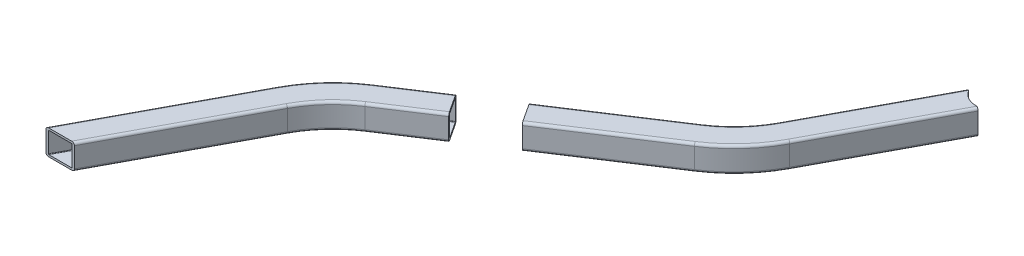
ISO-10303-21;
HEADER;
FILE_DESCRIPTION(('STEP AP214'),'2;1');
FILE_NAME('part.step','',(''),(''),'','','');
FILE_SCHEMA(('AUTOMOTIVE_DESIGN { 1 0 10303 214 1 1 1 1 }'));
ENDSEC;
DATA;
#1=APPLICATION_CONTEXT('core data for automotive mechanical design processes');
#2=APPLICATION_PROTOCOL_DEFINITION('international standard','automotive_design',2000,#1);
#3=PRODUCT_CONTEXT('',#1,'mechanical');
#4=PRODUCT('Part','Part','',(#3));
#5=PRODUCT_RELATED_PRODUCT_CATEGORY('part','',(#4));
#6=PRODUCT_DEFINITION_FORMATION('','',#4);
#7=PRODUCT_DEFINITION_CONTEXT('part definition',#1,'design');
#8=PRODUCT_DEFINITION('design','',#6,#7);
#9=PRODUCT_DEFINITION_SHAPE('','',#8);
#10=(LENGTH_UNIT() NAMED_UNIT(*) SI_UNIT(.MILLI.,.METRE.));
#11=(NAMED_UNIT(*) PLANE_ANGLE_UNIT() SI_UNIT($,.RADIAN.));
#12=(NAMED_UNIT(*) SI_UNIT($,.STERADIAN.) SOLID_ANGLE_UNIT());
#13=UNCERTAINTY_MEASURE_WITH_UNIT(LENGTH_MEASURE(1.E-05),#10,'distance_accuracy_value','');
#14=(GEOMETRIC_REPRESENTATION_CONTEXT(3) GLOBAL_UNCERTAINTY_ASSIGNED_CONTEXT((#13)) GLOBAL_UNIT_ASSIGNED_CONTEXT((#10,
#11,#12)) REPRESENTATION_CONTEXT('',''));
#15=CARTESIAN_POINT('',(0.,0.,0.));
#16=DIRECTION('',(0.,0.,1.));
#17=DIRECTION('',(1.,0.,0.));
#18=AXIS2_PLACEMENT_3D('',#15,#16,#17);
#19=CARTESIAN_POINT('',(155.993078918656,9.99999999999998,-133.085003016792));
#20=DIRECTION('',(0.881735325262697,0.,0.471744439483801));
#21=DIRECTION('',(0.471744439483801,0.,-0.881735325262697));
#22=AXIS2_PLACEMENT_3D('',#19,#20,#21);
#23=PLANE('',#22);
#24=DIRECTION('',(0.,-1.,0.));
#25=VECTOR('',#24,1.);
#26=CARTESIAN_POINT('',(221.357043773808,847.505834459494,-255.256483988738));
#27=LINE('',#26,#25);
#28=CARTESIAN_POINT('',(221.357043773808,9.99999999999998,-255.256483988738));
#29=VERTEX_POINT('',#28);
#30=CARTESIAN_POINT('',(221.357043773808,-9.99999999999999,-255.256483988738));
#31=VERTEX_POINT('',#30);
#32=EDGE_CURVE('E347',#29,#31,#27,.T.);
#33=ORIENTED_EDGE('',*,*,#32,.T.);
#34=DIRECTION('',(0.471744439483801,0.,-0.881735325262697));
#35=VECTOR('',#34,1.);
#36=CARTESIAN_POINT('',(155.993078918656,-9.99999999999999,-133.085003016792));
#37=LINE('',#36,#35);
#38=CARTESIAN_POINT('',(155.993078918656,-9.99999999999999,-133.085003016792));
#39=VERTEX_POINT('',#38);
#40=EDGE_CURVE('E515',#39,#31,#37,.T.);
#41=ORIENTED_EDGE('',*,*,#40,.F.);
#42=DIRECTION('',(0.,-1.,0.));
#43=VECTOR('',#42,1.);
#44=CARTESIAN_POINT('',(155.993078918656,9.99999999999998,-133.085003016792));
#45=LINE('',#44,#43);
#46=CARTESIAN_POINT('',(155.993078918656,9.99999999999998,-133.085003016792));
#47=VERTEX_POINT('',#46);
#48=EDGE_CURVE('E466',#47,#39,#45,.T.);
#49=ORIENTED_EDGE('',*,*,#48,.F.);
#50=DIRECTION('',(0.471744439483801,0.,-0.881735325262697));
#51=VECTOR('',#50,1.);
#52=CARTESIAN_POINT('',(155.993078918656,9.99999999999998,-133.085003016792));
#53=LINE('',#52,#51);
#54=EDGE_CURVE('E349',#47,#29,#53,.T.);
#55=ORIENTED_EDGE('',*,*,#54,.T.);
#56=EDGE_LOOP('',(#33,#41,#49,#55));
#57=FACE_BOUND('',#56,.T.);
#58=ADVANCED_FACE('F44',(#57),#23,.F.);
#59=CARTESIAN_POINT('',(158.197417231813,10.,-131.905641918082));
#60=DIRECTION('',(0.471744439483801,0.,-0.881735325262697));
#61=DIRECTION('',(-0.881735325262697,0.,-0.471744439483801));
#62=AXIS2_PLACEMENT_3D('',#59,#60,#61);
#63=CYLINDRICAL_SURFACE('',#62,2.5);
#64=CARTESIAN_POINT('',(223.561382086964,10.,-254.077122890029));
#65=DIRECTION('',(0.4717444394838,0.,-0.881735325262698));
#66=DIRECTION('',(-0.881735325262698,0.,-0.4717444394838));
#67=AXIS2_PLACEMENT_3D('',#64,#65,#66);
#68=CIRCLE('',#67,2.5);
#69=CARTESIAN_POINT('',(223.561382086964,12.5,-254.077122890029));
#70=VERTEX_POINT('',#69);
#71=EDGE_CURVE('E365',#29,#70,#68,.T.);
#72=ORIENTED_EDGE('',*,*,#71,.F.);
#73=ORIENTED_EDGE('',*,*,#54,.F.);
#74=CARTESIAN_POINT('',(158.197417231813,10.,-131.905641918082));
#75=DIRECTION('',(-0.471744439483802,0.,0.881735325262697));
#76=DIRECTION('',(0.881735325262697,0.,0.471744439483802));
#77=AXIS2_PLACEMENT_3D('',#74,#75,#76);
#78=CIRCLE('',#77,2.5);
#79=CARTESIAN_POINT('',(158.197417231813,12.5,-131.905641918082));
#80=VERTEX_POINT('',#79);
#81=EDGE_CURVE('E462',#80,#47,#78,.T.);
#82=ORIENTED_EDGE('',*,*,#81,.F.);
#83=DIRECTION('',(0.471744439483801,0.,-0.881735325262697));
#84=VECTOR('',#83,1.);
#85=CARTESIAN_POINT('',(158.197417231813,12.5,-131.905641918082));
#86=LINE('',#85,#84);
#87=EDGE_CURVE('E528',#80,#70,#86,.T.);
#88=ORIENTED_EDGE('',*,*,#87,.T.);
#89=EDGE_LOOP('',(#72,#73,#82,#88));
#90=FACE_BOUND('',#89,.T.);
#91=ADVANCED_FACE('F557',(#90),#63,.T.);
#92=CARTESIAN_POINT('',(175.832123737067,10.,-122.470753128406));
#93=DIRECTION('',(0.471744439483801,0.,-0.881735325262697));
#94=DIRECTION('',(-0.881735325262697,0.,-0.471744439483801));
#95=AXIS2_PLACEMENT_3D('',#92,#93,#94);
#96=CYLINDRICAL_SURFACE('',#95,2.5);
#97=CARTESIAN_POINT('',(241.196088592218,10.,-244.642234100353));
#98=DIRECTION('',(0.4717444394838,0.,-0.881735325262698));
#99=DIRECTION('',(-0.881735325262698,0.,-0.4717444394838));
#100=AXIS2_PLACEMENT_3D('',#97,#98,#99);
#101=CIRCLE('',#100,2.5);
#102=CARTESIAN_POINT('',(241.196088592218,12.5,-244.642234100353));
#103=VERTEX_POINT('',#102);
#104=CARTESIAN_POINT('',(243.400426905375,9.99999999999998,-243.462873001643));
#105=VERTEX_POINT('',#104);
#106=EDGE_CURVE('E362',#103,#105,#101,.T.);
#107=ORIENTED_EDGE('',*,*,#106,.F.);
#108=DIRECTION('',(0.471744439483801,0.,-0.881735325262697));
#109=VECTOR('',#108,1.);
#110=CARTESIAN_POINT('',(175.832123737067,12.5,-122.470753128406));
#111=LINE('',#110,#109);
#112=CARTESIAN_POINT('',(175.832123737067,12.5,-122.470753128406));
#113=VERTEX_POINT('',#112);
#114=EDGE_CURVE('E334',#113,#103,#111,.T.);
#115=ORIENTED_EDGE('',*,*,#114,.F.);
#116=CARTESIAN_POINT('',(175.832123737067,10.,-122.470753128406));
#117=DIRECTION('',(-0.471744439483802,0.,0.881735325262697));
#118=DIRECTION('',(-0.881735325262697,0.,-0.471744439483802));
#119=AXIS2_PLACEMENT_3D('',#116,#117,#118);
#120=CIRCLE('',#119,2.5);
#121=CARTESIAN_POINT('',(178.036462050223,9.99999999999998,-121.291392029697));
#122=VERTEX_POINT('',#121);
#123=EDGE_CURVE('E458',#122,#113,#120,.T.);
#124=ORIENTED_EDGE('',*,*,#123,.F.);
#125=DIRECTION('',(0.471744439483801,0.,-0.881735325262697));
#126=VECTOR('',#125,1.);
#127=CARTESIAN_POINT('',(178.036462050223,9.99999999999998,-121.291392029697));
#128=LINE('',#127,#126);
#129=EDGE_CURVE('E525',#122,#105,#128,.T.);
#130=ORIENTED_EDGE('',*,*,#129,.T.);
#131=EDGE_LOOP('',(#107,#115,#124,#130));
#132=FACE_BOUND('',#131,.T.);
#133=ADVANCED_FACE('F608',(#132),#96,.T.);
#134=CARTESIAN_POINT('',(178.036462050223,9.99999999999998,-121.291392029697));
#135=DIRECTION('',(-0.881735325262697,0.,-0.471744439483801));
#136=DIRECTION('',(-0.471744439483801,0.,0.881735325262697));
#137=AXIS2_PLACEMENT_3D('',#134,#135,#136);
#138=PLANE('',#137);
#139=DIRECTION('',(0.,-1.,0.));
#140=VECTOR('',#139,1.);
#141=CARTESIAN_POINT('',(243.400426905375,847.505834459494,-243.462873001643));
#142=LINE('',#141,#140);
#143=CARTESIAN_POINT('',(243.400426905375,-9.99999999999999,-243.462873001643));
#144=VERTEX_POINT('',#143);
#145=EDGE_CURVE('E342',#105,#144,#142,.T.);
#146=ORIENTED_EDGE('',*,*,#145,.F.);
#147=ORIENTED_EDGE('',*,*,#129,.F.);
#148=DIRECTION('',(0.,1.,0.));
#149=VECTOR('',#148,1.);
#150=CARTESIAN_POINT('',(178.036462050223,9.99999999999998,-121.291392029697));
#151=LINE('',#150,#149);
#152=CARTESIAN_POINT('',(178.036462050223,-9.99999999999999,-121.291392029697));
#153=VERTEX_POINT('',#152);
#154=EDGE_CURVE('E454',#153,#122,#151,.T.);
#155=ORIENTED_EDGE('',*,*,#154,.F.);
#156=DIRECTION('',(0.471744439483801,0.,-0.881735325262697));
#157=VECTOR('',#156,1.);
#158=CARTESIAN_POINT('',(178.036462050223,-9.99999999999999,-121.291392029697));
#159=LINE('',#158,#157);
#160=EDGE_CURVE('E522',#153,#144,#159,.T.);
#161=ORIENTED_EDGE('',*,*,#160,.T.);
#162=EDGE_LOOP('',(#146,#147,#155,#161));
#163=FACE_BOUND('',#162,.T.);
#164=ADVANCED_FACE('F697',(#163),#138,.F.);
#165=CARTESIAN_POINT('',(175.832123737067,-10.,-122.470753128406));
#166=DIRECTION('',(0.471744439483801,0.,-0.881735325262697));
#167=DIRECTION('',(-0.881735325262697,0.,-0.471744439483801));
#168=AXIS2_PLACEMENT_3D('',#165,#166,#167);
#169=CYLINDRICAL_SURFACE('',#168,2.5);
#170=CARTESIAN_POINT('',(241.196088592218,-10.,-244.642234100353));
#171=DIRECTION('',(0.4717444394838,0.,-0.881735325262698));
#172=DIRECTION('',(-0.881735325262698,0.,-0.4717444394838));
#173=AXIS2_PLACEMENT_3D('',#170,#171,#172);
#174=CIRCLE('',#173,2.5);
#175=CARTESIAN_POINT('',(241.196088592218,-12.5,-244.642234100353));
#176=VERTEX_POINT('',#175);
#177=EDGE_CURVE('E345',#144,#176,#174,.T.);
#178=ORIENTED_EDGE('',*,*,#177,.F.);
#179=ORIENTED_EDGE('',*,*,#160,.F.);
#180=CARTESIAN_POINT('',(175.832123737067,-10.,-122.470753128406));
#181=DIRECTION('',(-0.471744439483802,0.,0.881735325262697));
#182=DIRECTION('',(0.881735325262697,0.,0.471744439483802));
#183=AXIS2_PLACEMENT_3D('',#180,#181,#182);
#184=CIRCLE('',#183,2.5);
#185=CARTESIAN_POINT('',(175.832123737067,-12.5,-122.470753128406));
#186=VERTEX_POINT('',#185);
#187=EDGE_CURVE('E450',#186,#153,#184,.T.);
#188=ORIENTED_EDGE('',*,*,#187,.F.);
#189=DIRECTION('',(0.471744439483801,0.,-0.881735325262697));
#190=VECTOR('',#189,1.);
#191=CARTESIAN_POINT('',(175.832123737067,-12.5,-122.470753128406));
#192=LINE('',#191,#190);
#193=EDGE_CURVE('E519',#186,#176,#192,.T.);
#194=ORIENTED_EDGE('',*,*,#193,.T.);
#195=EDGE_LOOP('',(#178,#179,#188,#194));
#196=FACE_BOUND('',#195,.T.);
#197=ADVANCED_FACE('F700',(#196),#169,.T.);
#198=CARTESIAN_POINT('',(158.197417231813,-10.,-131.905641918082));
#199=DIRECTION('',(0.471744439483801,0.,-0.881735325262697));
#200=DIRECTION('',(-0.881735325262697,0.,-0.471744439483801));
#201=AXIS2_PLACEMENT_3D('',#198,#199,#200);
#202=CYLINDRICAL_SURFACE('',#201,2.5);
#203=CARTESIAN_POINT('',(223.561382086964,-10.,-254.077122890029));
#204=DIRECTION('',(0.4717444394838,0.,-0.881735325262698));
#205=DIRECTION('',(-0.881735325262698,0.,-0.4717444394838));
#206=AXIS2_PLACEMENT_3D('',#203,#204,#205);
#207=CIRCLE('',#206,2.5);
#208=CARTESIAN_POINT('',(223.561382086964,-12.5,-254.077122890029));
#209=VERTEX_POINT('',#208);
#210=EDGE_CURVE('E336',#209,#31,#207,.T.);
#211=ORIENTED_EDGE('',*,*,#210,.F.);
#212=DIRECTION('',(0.471744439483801,0.,-0.881735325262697));
#213=VECTOR('',#212,1.);
#214=CARTESIAN_POINT('',(158.197417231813,-12.5,-131.905641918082));
#215=LINE('',#214,#213);
#216=CARTESIAN_POINT('',(158.197417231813,-12.5,-131.905641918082));
#217=VERTEX_POINT('',#216);
#218=EDGE_CURVE('E394',#217,#209,#215,.T.);
#219=ORIENTED_EDGE('',*,*,#218,.F.);
#220=CARTESIAN_POINT('',(158.197417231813,-10.,-131.905641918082));
#221=DIRECTION('',(-0.471744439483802,0.,0.881735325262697));
#222=DIRECTION('',(0.881735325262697,0.,0.471744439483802));
#223=AXIS2_PLACEMENT_3D('',#220,#221,#222);
#224=CIRCLE('',#223,2.5);
#225=EDGE_CURVE('E422',#39,#217,#224,.T.);
#226=ORIENTED_EDGE('',*,*,#225,.F.);
#227=ORIENTED_EDGE('',*,*,#40,.T.);
#228=EDGE_LOOP('',(#211,#219,#226,#227));
#229=FACE_BOUND('',#228,.T.);
#230=ADVANCED_FACE('F704',(#229),#202,.T.);
#231=CARTESIAN_POINT('',(157.756549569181,9.99999999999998,-132.141514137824));
#232=DIRECTION('',(0.881735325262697,0.,0.471744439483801));
#233=DIRECTION('',(0.471744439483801,0.,-0.881735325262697));
#234=AXIS2_PLACEMENT_3D('',#231,#232,#233);
#235=PLANE('',#234);
#236=DIRECTION('',(0.471744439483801,0.,-0.881735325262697));
#237=VECTOR('',#236,1.);
#238=CARTESIAN_POINT('',(157.756549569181,-10.,-132.141514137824));
#239=LINE('',#238,#237);
#240=CARTESIAN_POINT('',(157.756549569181,-10.,-132.141514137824));
#241=VERTEX_POINT('',#240);
#242=CARTESIAN_POINT('',(223.120514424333,-10.,-254.312995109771));
#243=VERTEX_POINT('',#242);
#244=EDGE_CURVE('E377',#241,#243,#239,.T.);
#245=ORIENTED_EDGE('',*,*,#244,.T.);
#246=DIRECTION('',(0.,1.,0.));
#247=VECTOR('',#246,1.);
#248=CARTESIAN_POINT('',(223.120514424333,9.99999999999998,-254.312995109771));
#249=LINE('',#248,#247);
#250=CARTESIAN_POINT('',(223.120514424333,9.99999999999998,-254.312995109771));
#251=VERTEX_POINT('',#250);
#252=EDGE_CURVE('E374',#243,#251,#249,.T.);
#253=ORIENTED_EDGE('',*,*,#252,.T.);
#254=DIRECTION('',(0.471744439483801,0.,-0.881735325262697));
#255=VECTOR('',#254,1.);
#256=CARTESIAN_POINT('',(157.756549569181,9.99999999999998,-132.141514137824));
#257=LINE('',#256,#255);
#258=CARTESIAN_POINT('',(157.756549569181,9.99999999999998,-132.141514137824));
#259=VERTEX_POINT('',#258);
#260=EDGE_CURVE('E384',#259,#251,#257,.T.);
#261=ORIENTED_EDGE('',*,*,#260,.F.);
#262=DIRECTION('',(0.,-1.,0.));
#263=VECTOR('',#262,1.);
#264=CARTESIAN_POINT('',(157.756549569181,9.99999999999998,-132.141514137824));
#265=LINE('',#264,#263);
#266=EDGE_CURVE('E376',#259,#241,#265,.T.);
#267=ORIENTED_EDGE('',*,*,#266,.T.);
#268=EDGE_LOOP('',(#245,#253,#261,#267));
#269=FACE_BOUND('',#268,.T.);
#270=ADVANCED_FACE('F654',(#269),#235,.T.);
#271=CARTESIAN_POINT('',(158.197417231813,-10.,-131.905641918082));
#272=DIRECTION('',(0.471744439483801,0.,-0.881735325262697));
#273=DIRECTION('',(-0.881735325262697,0.,-0.471744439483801));
#274=AXIS2_PLACEMENT_3D('',#271,#272,#273);
#275=CYLINDRICAL_SURFACE('',#274,0.500000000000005);
#276=DIRECTION('',(0.471744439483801,0.,-0.881735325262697));
#277=VECTOR('',#276,1.);
#278=CARTESIAN_POINT('',(158.197417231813,-10.5,-131.905641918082));
#279=LINE('',#278,#277);
#280=CARTESIAN_POINT('',(158.197417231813,-10.5,-131.905641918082));
#281=VERTEX_POINT('',#280);
#282=CARTESIAN_POINT('',(223.561382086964,-10.5,-254.077122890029));
#283=VERTEX_POINT('',#282);
#284=EDGE_CURVE('E373',#281,#283,#279,.T.);
#285=ORIENTED_EDGE('',*,*,#284,.T.);
#286=CARTESIAN_POINT('',(223.561382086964,-10.,-254.077122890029));
#287=DIRECTION('',(0.4717444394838,0.,-0.881735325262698));
#288=DIRECTION('',(-0.881735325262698,0.,-0.4717444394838));
#289=AXIS2_PLACEMENT_3D('',#286,#287,#288);
#290=CIRCLE('',#289,0.500000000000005);
#291=EDGE_CURVE('E370',#283,#243,#290,.T.);
#292=ORIENTED_EDGE('',*,*,#291,.T.);
#293=ORIENTED_EDGE('',*,*,#244,.F.);
#294=CARTESIAN_POINT('',(158.197417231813,-10.,-131.905641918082));
#295=DIRECTION('',(-0.471744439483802,0.,0.881735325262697));
#296=DIRECTION('',(0.881735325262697,0.,0.471744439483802));
#297=AXIS2_PLACEMENT_3D('',#294,#295,#296);
#298=CIRCLE('',#297,0.500000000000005);
#299=EDGE_CURVE('E372',#241,#281,#298,.T.);
#300=ORIENTED_EDGE('',*,*,#299,.T.);
#301=EDGE_LOOP('',(#285,#292,#293,#300));
#302=FACE_BOUND('',#301,.T.);
#303=ADVANCED_FACE('F651',(#302),#275,.F.);
#304=CARTESIAN_POINT('',(175.832123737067,-10.,-122.470753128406));
#305=DIRECTION('',(0.471744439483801,0.,-0.881735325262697));
#306=DIRECTION('',(-0.881735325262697,0.,-0.471744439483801));
#307=AXIS2_PLACEMENT_3D('',#304,#305,#306);
#308=CYLINDRICAL_SURFACE('',#307,0.500000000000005);
#309=DIRECTION('',(0.471744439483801,0.,-0.881735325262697));
#310=VECTOR('',#309,1.);
#311=CARTESIAN_POINT('',(176.272991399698,-9.99999999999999,-122.234880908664));
#312=LINE('',#311,#310);
#313=CARTESIAN_POINT('',(176.272991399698,-9.99999999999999,-122.234880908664));
#314=VERTEX_POINT('',#313);
#315=CARTESIAN_POINT('',(241.63695625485,-9.99999999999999,-244.406361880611));
#316=VERTEX_POINT('',#315);
#317=EDGE_CURVE('E361',#314,#316,#312,.T.);
#318=ORIENTED_EDGE('',*,*,#317,.T.);
#319=CARTESIAN_POINT('',(241.196088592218,-10.,-244.642234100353));
#320=DIRECTION('',(0.4717444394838,0.,-0.881735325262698));
#321=DIRECTION('',(-0.881735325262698,0.,-0.4717444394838));
#322=AXIS2_PLACEMENT_3D('',#319,#320,#321);
#323=CIRCLE('',#322,0.500000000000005);
#324=CARTESIAN_POINT('',(241.196088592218,-10.5,-244.642234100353));
#325=VERTEX_POINT('',#324);
#326=EDGE_CURVE('E358',#316,#325,#323,.T.);
#327=ORIENTED_EDGE('',*,*,#326,.T.);
#328=DIRECTION('',(0.471744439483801,0.,-0.881735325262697));
#329=VECTOR('',#328,1.);
#330=CARTESIAN_POINT('',(175.832123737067,-10.5,-122.470753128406));
#331=LINE('',#330,#329);
#332=CARTESIAN_POINT('',(175.832123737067,-10.5,-122.470753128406));
#333=VERTEX_POINT('',#332);
#334=EDGE_CURVE('E400',#333,#325,#331,.T.);
#335=ORIENTED_EDGE('',*,*,#334,.F.);
#336=CARTESIAN_POINT('',(175.832123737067,-10.,-122.470753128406));
#337=DIRECTION('',(-0.471744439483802,0.,0.881735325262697));
#338=DIRECTION('',(0.881735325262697,0.,0.471744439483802));
#339=AXIS2_PLACEMENT_3D('',#336,#337,#338);
#340=CIRCLE('',#339,0.500000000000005);
#341=EDGE_CURVE('E360',#333,#314,#340,.T.);
#342=ORIENTED_EDGE('',*,*,#341,.T.);
#343=EDGE_LOOP('',(#318,#327,#335,#342));
#344=FACE_BOUND('',#343,.T.);
#345=ADVANCED_FACE('F640',(#344),#308,.F.);
#346=CARTESIAN_POINT('',(176.272991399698,9.99999999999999,-122.234880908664));
#347=DIRECTION('',(-0.881735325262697,0.,-0.471744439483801));
#348=DIRECTION('',(-0.471744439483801,0.,0.881735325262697));
#349=AXIS2_PLACEMENT_3D('',#346,#347,#348);
#350=PLANE('',#349);
#351=DIRECTION('',(0.471744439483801,0.,-0.881735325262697));
#352=VECTOR('',#351,1.);
#353=CARTESIAN_POINT('',(176.272991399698,9.99999999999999,-122.234880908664));
#354=LINE('',#353,#352);
#355=CARTESIAN_POINT('',(176.272991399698,9.99999999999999,-122.234880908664));
#356=VERTEX_POINT('',#355);
#357=CARTESIAN_POINT('',(241.63695625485,9.99999999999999,-244.406361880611));
#358=VERTEX_POINT('',#357);
#359=EDGE_CURVE('E357',#356,#358,#354,.T.);
#360=ORIENTED_EDGE('',*,*,#359,.T.);
#361=DIRECTION('',(0.,-1.,0.));
#362=VECTOR('',#361,1.);
#363=CARTESIAN_POINT('',(241.63695625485,9.99999999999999,-244.406361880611));
#364=LINE('',#363,#362);
#365=EDGE_CURVE('E354',#358,#316,#364,.T.);
#366=ORIENTED_EDGE('',*,*,#365,.T.);
#367=ORIENTED_EDGE('',*,*,#317,.F.);
#368=DIRECTION('',(0.,1.,0.));
#369=VECTOR('',#368,1.);
#370=CARTESIAN_POINT('',(176.272991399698,9.99999999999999,-122.234880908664));
#371=LINE('',#370,#369);
#372=EDGE_CURVE('E356',#314,#356,#371,.T.);
#373=ORIENTED_EDGE('',*,*,#372,.T.);
#374=EDGE_LOOP('',(#360,#366,#367,#373));
#375=FACE_BOUND('',#374,.T.);
#376=ADVANCED_FACE('F643',(#375),#350,.T.);
#377=CARTESIAN_POINT('',(175.832123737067,10.,-122.470753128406));
#378=DIRECTION('',(0.471744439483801,0.,-0.881735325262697));
#379=DIRECTION('',(-0.881735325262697,0.,-0.471744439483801));
#380=AXIS2_PLACEMENT_3D('',#377,#378,#379);
#381=CYLINDRICAL_SURFACE('',#380,0.500000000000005);
#382=DIRECTION('',(0.471744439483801,0.,-0.881735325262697));
#383=VECTOR('',#382,1.);
#384=CARTESIAN_POINT('',(175.832123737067,10.5,-122.470753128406));
#385=LINE('',#384,#383);
#386=CARTESIAN_POINT('',(175.832123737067,10.5,-122.470753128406));
#387=VERTEX_POINT('',#386);
#388=CARTESIAN_POINT('',(241.196088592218,10.5,-244.642234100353));
#389=VERTEX_POINT('',#388);
#390=EDGE_CURVE('E353',#387,#389,#385,.T.);
#391=ORIENTED_EDGE('',*,*,#390,.T.);
#392=CARTESIAN_POINT('',(241.196088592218,10.,-244.642234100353));
#393=DIRECTION('',(0.4717444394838,0.,-0.881735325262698));
#394=DIRECTION('',(-0.881735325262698,0.,-0.4717444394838));
#395=AXIS2_PLACEMENT_3D('',#392,#393,#394);
#396=CIRCLE('',#395,0.500000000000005);
#397=EDGE_CURVE('E350',#389,#358,#396,.T.);
#398=ORIENTED_EDGE('',*,*,#397,.T.);
#399=ORIENTED_EDGE('',*,*,#359,.F.);
#400=CARTESIAN_POINT('',(175.832123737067,10.,-122.470753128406));
#401=DIRECTION('',(-0.471744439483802,0.,0.881735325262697));
#402=DIRECTION('',(-0.881735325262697,0.,-0.471744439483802));
#403=AXIS2_PLACEMENT_3D('',#400,#401,#402);
#404=CIRCLE('',#403,0.500000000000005);
#405=EDGE_CURVE('E352',#356,#387,#404,.T.);
#406=ORIENTED_EDGE('',*,*,#405,.T.);
#407=EDGE_LOOP('',(#391,#398,#399,#406));
#408=FACE_BOUND('',#407,.T.);
#409=ADVANCED_FACE('F614',(#408),#381,.F.);
#410=CARTESIAN_POINT('',(158.197417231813,10.,-131.905641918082));
#411=DIRECTION('',(0.471744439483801,0.,-0.881735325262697));
#412=DIRECTION('',(-0.881735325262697,0.,-0.471744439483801));
#413=AXIS2_PLACEMENT_3D('',#410,#411,#412);
#414=CYLINDRICAL_SURFACE('',#413,0.500000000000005);
#415=ORIENTED_EDGE('',*,*,#260,.T.);
#416=CARTESIAN_POINT('',(223.561382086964,10.,-254.077122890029));
#417=DIRECTION('',(0.4717444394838,0.,-0.881735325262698));
#418=DIRECTION('',(-0.881735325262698,0.,-0.4717444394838));
#419=AXIS2_PLACEMENT_3D('',#416,#417,#418);
#420=CIRCLE('',#419,0.500000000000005);
#421=CARTESIAN_POINT('',(223.561382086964,10.5,-254.077122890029));
#422=VERTEX_POINT('',#421);
#423=EDGE_CURVE('E381',#251,#422,#420,.T.);
#424=ORIENTED_EDGE('',*,*,#423,.T.);
#425=DIRECTION('',(0.471744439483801,0.,-0.881735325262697));
#426=VECTOR('',#425,1.);
#427=CARTESIAN_POINT('',(158.197417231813,10.5,-131.905641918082));
#428=LINE('',#427,#426);
#429=CARTESIAN_POINT('',(158.197417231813,10.5,-131.905641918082));
#430=VERTEX_POINT('',#429);
#431=EDGE_CURVE('E397',#430,#422,#428,.T.);
#432=ORIENTED_EDGE('',*,*,#431,.F.);
#433=CARTESIAN_POINT('',(158.197417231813,10.,-131.905641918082));
#434=DIRECTION('',(-0.471744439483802,0.,0.881735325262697));
#435=DIRECTION('',(0.881735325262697,0.,0.471744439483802));
#436=AXIS2_PLACEMENT_3D('',#433,#434,#435);
#437=CIRCLE('',#436,0.500000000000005);
#438=EDGE_CURVE('E383',#430,#259,#437,.T.);
#439=ORIENTED_EDGE('',*,*,#438,.T.);
#440=EDGE_LOOP('',(#415,#424,#432,#439));
#441=FACE_BOUND('',#440,.T.);
#442=ADVANCED_FACE('F656',(#441),#414,.F.);
#443=CARTESIAN_POINT('',(240.,-12.5,-263.604548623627));
#444=DIRECTION('',(0.,1.,0.));
#445=DIRECTION('',(0.,0.,1.));
#446=AXIS2_PLACEMENT_3D('',#443,#444,#445);
#447=CYLINDRICAL_SURFACE('',#446,19.);
#448=DIRECTION('',(0.,1.,0.));
#449=VECTOR('',#448,1.);
#450=CARTESIAN_POINT('',(223.561382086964,-12.5,-254.077122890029));
#451=LINE('',#450,#449);
#452=EDGE_CURVE('E387',#70,#422,#451,.F.);
#453=ORIENTED_EDGE('',*,*,#452,.F.);
#454=CARTESIAN_POINT('',(240.,12.5,-263.604548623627));
#455=DIRECTION('',(0.,1.,0.));
#456=DIRECTION('',(0.,0.,1.));
#457=AXIS2_PLACEMENT_3D('',#454,#455,#456);
#458=CIRCLE('',#457,19.);
#459=EDGE_CURVE('E388',#70,#103,#458,.T.);
#460=ORIENTED_EDGE('',*,*,#459,.T.);
#461=DIRECTION('',(0.,1.,0.));
#462=VECTOR('',#461,1.);
#463=CARTESIAN_POINT('',(241.196088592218,-12.5,-244.642234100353));
#464=LINE('',#463,#462);
#465=EDGE_CURVE('E366',#389,#103,#464,.T.);
#466=ORIENTED_EDGE('',*,*,#465,.F.);
#467=CARTESIAN_POINT('',(240.,10.5,-263.604548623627));
#468=DIRECTION('',(0.,1.,0.));
#469=DIRECTION('',(0.,0.,1.));
#470=AXIS2_PLACEMENT_3D('',#467,#468,#469);
#471=CIRCLE('',#470,19.);
#472=EDGE_CURVE('E321',#422,#389,#471,.T.);
#473=ORIENTED_EDGE('',*,*,#472,.F.);
#474=EDGE_LOOP('',(#453,#460,#466,#473));
#475=FACE_BOUND('',#474,.T.);
#476=ADVANCED_FACE('F549',(#475),#447,.F.);
#477=EDGE_CURVE('E380',#283,#209,#451,.F.);
#478=ORIENTED_EDGE('',*,*,#477,.F.);
#479=CARTESIAN_POINT('',(240.,-10.5,-263.604548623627));
#480=DIRECTION('',(0.,-1.,0.));
#481=DIRECTION('',(0.,0.,-1.));
#482=AXIS2_PLACEMENT_3D('',#479,#480,#481);
#483=CIRCLE('',#482,19.);
#484=EDGE_CURVE('E265',#325,#283,#483,.T.);
#485=ORIENTED_EDGE('',*,*,#484,.F.);
#486=EDGE_CURVE('E369',#176,#325,#464,.T.);
#487=ORIENTED_EDGE('',*,*,#486,.F.);
#488=CARTESIAN_POINT('',(240.,-12.5,-263.604548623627));
#489=DIRECTION('',(0.,1.,0.));
#490=DIRECTION('',(0.,0.,1.));
#491=AXIS2_PLACEMENT_3D('',#488,#489,#490);
#492=CIRCLE('',#491,19.);
#493=EDGE_CURVE('E346',#209,#176,#492,.T.);
#494=ORIENTED_EDGE('',*,*,#493,.F.);
#495=EDGE_LOOP('',(#478,#485,#487,#494));
#496=FACE_BOUND('',#495,.T.);
#497=ADVANCED_FACE('F647',(#496),#447,.F.);
#498=CARTESIAN_POINT('',(58.5613254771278,0.,-185.212763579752));
#499=DIRECTION('',(0.,1.,0.));
#500=DIRECTION('',(0.,0.,1.));
#501=AXIS2_PLACEMENT_3D('',#498,#499,#500);
#502=CYLINDRICAL_SURFACE('',#501,110.5);
#503=DIRECTION('',(0.,-1.,0.));
#504=VECTOR('',#503,1.);
#505=CARTESIAN_POINT('',(119.013807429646,9.99999999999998,-92.7154802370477));
#506=LINE('',#505,#504);
#507=CARTESIAN_POINT('',(119.013807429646,9.99999999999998,-92.7154802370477));
#508=VERTEX_POINT('',#507);
#509=CARTESIAN_POINT('',(119.013807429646,-9.99999999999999,-92.7154802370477));
#510=VERTEX_POINT('',#509);
#511=EDGE_CURVE('E317',#508,#510,#506,.T.);
#512=ORIENTED_EDGE('',*,*,#511,.F.);
#513=CARTESIAN_POINT('',(58.5613254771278,9.99999999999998,-185.212763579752));
#514=DIRECTION('',(0.,1.,0.));
#515=DIRECTION('',(0.,0.,1.));
#516=AXIS2_PLACEMENT_3D('',#513,#514,#515);
#517=CIRCLE('',#516,110.5);
#518=EDGE_CURVE('E391',#508,#47,#517,.T.);
#519=ORIENTED_EDGE('',*,*,#518,.T.);
#520=ORIENTED_EDGE('',*,*,#48,.T.);
#521=CARTESIAN_POINT('',(58.5613254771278,-9.99999999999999,-185.212763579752));
#522=DIRECTION('',(0.,1.,0.));
#523=DIRECTION('',(0.,0.,1.));
#524=AXIS2_PLACEMENT_3D('',#521,#522,#523);
#525=CIRCLE('',#524,110.5);
#526=EDGE_CURVE('E449',#510,#39,#525,.T.);
#527=ORIENTED_EDGE('',*,*,#526,.F.);
#528=EDGE_LOOP('',(#512,#519,#520,#527));
#529=FACE_BOUND('',#528,.T.);
#530=ADVANCED_FACE('F573',(#529),#502,.F.);
#531=CARTESIAN_POINT('',(58.5613254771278,10.,-185.212763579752));
#532=DIRECTION('',(0.,1.,0.));
#533=DIRECTION('',(0.,0.,1.));
#534=AXIS2_PLACEMENT_3D('',#531,#532,#533);
#535=TOROIDAL_SURFACE('',#534,113.,2.5);
#536=CARTESIAN_POINT('',(120.381510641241,10.,-90.6227815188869));
#537=DIRECTION('',(-0.837079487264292,0.,0.54708128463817));
#538=DIRECTION('',(0.54708128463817,0.,0.837079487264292));
#539=AXIS2_PLACEMENT_3D('',#536,#537,#538);
#540=CIRCLE('',#539,2.5);
#541=CARTESIAN_POINT('',(120.381510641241,12.5,-90.6227815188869));
#542=VERTEX_POINT('',#541);
#543=EDGE_CURVE('E314',#542,#508,#540,.T.);
#544=ORIENTED_EDGE('',*,*,#543,.F.);
#545=CARTESIAN_POINT('',(58.5613254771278,12.5,-185.212763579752));
#546=DIRECTION('',(0.,1.,0.));
#547=DIRECTION('',(0.,0.,1.));
#548=AXIS2_PLACEMENT_3D('',#545,#546,#547);
#549=CIRCLE('',#548,113.);
#550=EDGE_CURVE('E465',#542,#80,#549,.T.);
#551=ORIENTED_EDGE('',*,*,#550,.T.);
#552=ORIENTED_EDGE('',*,*,#81,.T.);
#553=ORIENTED_EDGE('',*,*,#518,.F.);
#554=EDGE_LOOP('',(#544,#551,#552,#553));
#555=FACE_BOUND('',#554,.T.);
#556=ADVANCED_FACE('F562',(#555),#535,.T.);
#557=CARTESIAN_POINT('',(58.5613254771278,10.,-185.212763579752));
#558=DIRECTION('',(0.,1.,0.));
#559=DIRECTION('',(0.,0.,1.));
#560=AXIS2_PLACEMENT_3D('',#557,#558,#559);
#561=TOROIDAL_SURFACE('',#560,133.,2.5);
#562=CARTESIAN_POINT('',(131.323136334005,10.,-73.8811917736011));
#563=DIRECTION('',(-0.837079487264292,0.,0.54708128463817));
#564=DIRECTION('',(-0.54708128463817,0.,-0.837079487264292));
#565=AXIS2_PLACEMENT_3D('',#562,#563,#564);
#566=CIRCLE('',#565,2.5);
#567=CARTESIAN_POINT('',(132.6908395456,9.99999999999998,-71.7884930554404));
#568=VERTEX_POINT('',#567);
#569=CARTESIAN_POINT('',(131.323136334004,12.5,-73.8811917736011));
#570=VERTEX_POINT('',#569);
#571=EDGE_CURVE('E306',#568,#570,#566,.T.);
#572=ORIENTED_EDGE('',*,*,#571,.F.);
#573=CARTESIAN_POINT('',(58.5613254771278,9.99999999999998,-185.212763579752));
#574=DIRECTION('',(0.,1.,0.));
#575=DIRECTION('',(0.,0.,1.));
#576=AXIS2_PLACEMENT_3D('',#573,#574,#575);
#577=CIRCLE('',#576,135.5);
#578=EDGE_CURVE('E461',#568,#122,#577,.T.);
#579=ORIENTED_EDGE('',*,*,#578,.T.);
#580=ORIENTED_EDGE('',*,*,#123,.T.);
#581=CARTESIAN_POINT('',(58.5613254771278,12.5,-185.212763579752));
#582=DIRECTION('',(0.,1.,0.));
#583=DIRECTION('',(0.,0.,1.));
#584=AXIS2_PLACEMENT_3D('',#581,#582,#583);
#585=CIRCLE('',#584,133.);
#586=EDGE_CURVE('E311',#570,#113,#585,.T.);
#587=ORIENTED_EDGE('',*,*,#586,.F.);
#588=EDGE_LOOP('',(#572,#579,#580,#587));
#589=FACE_BOUND('',#588,.T.);
#590=ADVANCED_FACE('F605',(#589),#561,.T.);
#591=CARTESIAN_POINT('',(58.5613254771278,0.,-185.212763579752));
#592=DIRECTION('',(0.,1.,0.));
#593=DIRECTION('',(0.,0.,1.));
#594=AXIS2_PLACEMENT_3D('',#591,#592,#593);
#595=CYLINDRICAL_SURFACE('',#594,135.5);
#596=DIRECTION('',(0.,1.,0.));
#597=VECTOR('',#596,1.);
#598=CARTESIAN_POINT('',(132.6908395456,9.99999999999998,-71.7884930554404));
#599=LINE('',#598,#597);
#600=CARTESIAN_POINT('',(132.6908395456,-9.99999999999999,-71.7884930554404));
#601=VERTEX_POINT('',#600);
#602=EDGE_CURVE('E305',#601,#568,#599,.T.);
#603=ORIENTED_EDGE('',*,*,#602,.F.);
#604=CARTESIAN_POINT('',(58.5613254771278,-9.99999999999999,-185.212763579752));
#605=DIRECTION('',(0.,1.,0.));
#606=DIRECTION('',(0.,0.,1.));
#607=AXIS2_PLACEMENT_3D('',#604,#605,#606);
#608=CIRCLE('',#607,135.5);
#609=EDGE_CURVE('E457',#601,#153,#608,.T.);
#610=ORIENTED_EDGE('',*,*,#609,.T.);
#611=ORIENTED_EDGE('',*,*,#154,.T.);
#612=ORIENTED_EDGE('',*,*,#578,.F.);
#613=EDGE_LOOP('',(#603,#610,#611,#612));
#614=FACE_BOUND('',#613,.T.);
#615=ADVANCED_FACE('F601',(#614),#595,.T.);
#616=CARTESIAN_POINT('',(58.5613254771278,-10.,-185.212763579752));
#617=DIRECTION('',(0.,1.,0.));
#618=DIRECTION('',(0.,0.,1.));
#619=AXIS2_PLACEMENT_3D('',#616,#617,#618);
#620=TOROIDAL_SURFACE('',#619,133.,2.5);
#621=CARTESIAN_POINT('',(131.323136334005,-10.,-73.8811917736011));
#622=DIRECTION('',(-0.837079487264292,0.,0.54708128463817));
#623=DIRECTION('',(0.54708128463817,0.,0.837079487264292));
#624=AXIS2_PLACEMENT_3D('',#621,#622,#623);
#625=CIRCLE('',#624,2.5);
#626=CARTESIAN_POINT('',(131.323136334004,-12.5,-73.8811917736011));
#627=VERTEX_POINT('',#626);
#628=EDGE_CURVE('E301',#627,#601,#625,.T.);
#629=ORIENTED_EDGE('',*,*,#628,.F.);
#630=CARTESIAN_POINT('',(58.5613254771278,-12.5,-185.212763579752));
#631=DIRECTION('',(0.,1.,0.));
#632=DIRECTION('',(0.,0.,1.));
#633=AXIS2_PLACEMENT_3D('',#630,#631,#632);
#634=CIRCLE('',#633,133.);
#635=EDGE_CURVE('E453',#627,#186,#634,.T.);
#636=ORIENTED_EDGE('',*,*,#635,.T.);
#637=ORIENTED_EDGE('',*,*,#187,.T.);
#638=ORIENTED_EDGE('',*,*,#609,.F.);
#639=EDGE_LOOP('',(#629,#636,#637,#638));
#640=FACE_BOUND('',#639,.T.);
#641=ADVANCED_FACE('F729',(#640),#620,.T.);
#642=CARTESIAN_POINT('',(58.5613254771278,-10.,-185.212763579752));
#643=DIRECTION('',(0.,1.,0.));
#644=DIRECTION('',(0.,0.,1.));
#645=AXIS2_PLACEMENT_3D('',#642,#643,#644);
#646=TOROIDAL_SURFACE('',#645,113.,2.5);
#647=CARTESIAN_POINT('',(120.381510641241,-10.,-90.6227815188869));
#648=DIRECTION('',(-0.837079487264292,0.,0.54708128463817));
#649=DIRECTION('',(0.54708128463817,0.,0.837079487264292));
#650=AXIS2_PLACEMENT_3D('',#647,#648,#649);
#651=CIRCLE('',#650,2.5);
#652=CARTESIAN_POINT('',(120.381510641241,-12.5,-90.6227815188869));
#653=VERTEX_POINT('',#652);
#654=EDGE_CURVE('E294',#510,#653,#651,.T.);
#655=ORIENTED_EDGE('',*,*,#654,.F.);
#656=ORIENTED_EDGE('',*,*,#526,.T.);
#657=ORIENTED_EDGE('',*,*,#225,.T.);
#658=CARTESIAN_POINT('',(58.5613254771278,-12.5,-185.212763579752));
#659=DIRECTION('',(0.,1.,0.));
#660=DIRECTION('',(0.,0.,1.));
#661=AXIS2_PLACEMENT_3D('',#658,#659,#660);
#662=CIRCLE('',#661,113.);
#663=EDGE_CURVE('E298',#653,#217,#662,.T.);
#664=ORIENTED_EDGE('',*,*,#663,.F.);
#665=EDGE_LOOP('',(#655,#656,#657,#664));
#666=FACE_BOUND('',#665,.T.);
#667=ADVANCED_FACE('F577',(#666),#646,.T.);
#668=CARTESIAN_POINT('',(58.5613254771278,0.,-185.212763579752));
#669=DIRECTION('',(0.,1.,0.));
#670=DIRECTION('',(0.,0.,1.));
#671=AXIS2_PLACEMENT_3D('',#668,#669,#670);
#672=CYLINDRICAL_SURFACE('',#671,112.5);
#673=DIRECTION('',(0.,-1.,0.));
#674=VECTOR('',#673,1.);
#675=CARTESIAN_POINT('',(120.107969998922,9.99999999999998,-91.0413212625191));
#676=LINE('',#675,#674);
#677=CARTESIAN_POINT('',(120.107969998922,9.99999999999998,-91.0413212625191));
#678=VERTEX_POINT('',#677);
#679=CARTESIAN_POINT('',(120.107969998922,-10.,-91.0413212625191));
#680=VERTEX_POINT('',#679);
#681=EDGE_CURVE('E419',#678,#680,#676,.T.);
#682=ORIENTED_EDGE('',*,*,#681,.T.);
#683=CARTESIAN_POINT('',(58.5613254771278,-10.,-185.212763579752));
#684=DIRECTION('',(0.,1.,0.));
#685=DIRECTION('',(0.,0.,1.));
#686=AXIS2_PLACEMENT_3D('',#683,#684,#685);
#687=CIRCLE('',#686,112.5);
#688=EDGE_CURVE('E418',#680,#241,#687,.T.);
#689=ORIENTED_EDGE('',*,*,#688,.T.);
#690=ORIENTED_EDGE('',*,*,#266,.F.);
#691=CARTESIAN_POINT('',(58.5613254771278,9.99999999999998,-185.212763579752));
#692=DIRECTION('',(0.,1.,0.));
#693=DIRECTION('',(0.,0.,1.));
#694=AXIS2_PLACEMENT_3D('',#691,#692,#693);
#695=CIRCLE('',#694,112.5);
#696=EDGE_CURVE('E324',#678,#259,#695,.T.);
#697=ORIENTED_EDGE('',*,*,#696,.F.);
#698=EDGE_LOOP('',(#682,#689,#690,#697));
#699=FACE_BOUND('',#698,.T.);
#700=ADVANCED_FACE('F663',(#699),#672,.T.);
#701=CARTESIAN_POINT('',(58.5613254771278,-10.,-185.212763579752));
#702=DIRECTION('',(0.,1.,0.));
#703=DIRECTION('',(0.,0.,1.));
#704=AXIS2_PLACEMENT_3D('',#701,#702,#703);
#705=TOROIDAL_SURFACE('',#704,113.,0.500000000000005);
#706=CARTESIAN_POINT('',(120.381510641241,-10.,-90.6227815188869));
#707=DIRECTION('',(-0.837079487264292,0.,0.54708128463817));
#708=DIRECTION('',(0.54708128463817,0.,0.837079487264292));
#709=AXIS2_PLACEMENT_3D('',#706,#707,#708);
#710=CIRCLE('',#709,0.500000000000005);
#711=CARTESIAN_POINT('',(120.381510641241,-10.5,-90.6227815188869));
#712=VERTEX_POINT('',#711);
#713=EDGE_CURVE('E415',#680,#712,#710,.T.);
#714=ORIENTED_EDGE('',*,*,#713,.T.);
#715=CARTESIAN_POINT('',(58.5613254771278,-10.5,-185.212763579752));
#716=DIRECTION('',(0.,1.,0.));
#717=DIRECTION('',(0.,0.,1.));
#718=AXIS2_PLACEMENT_3D('',#715,#716,#717);
#719=CIRCLE('',#718,113.);
#720=EDGE_CURVE('E414',#712,#281,#719,.T.);
#721=ORIENTED_EDGE('',*,*,#720,.T.);
#722=ORIENTED_EDGE('',*,*,#299,.F.);
#723=ORIENTED_EDGE('',*,*,#688,.F.);
#724=EDGE_LOOP('',(#714,#721,#722,#723));
#725=FACE_BOUND('',#724,.T.);
#726=ADVANCED_FACE('F678',(#725),#705,.F.);
#727=CARTESIAN_POINT('',(58.5613254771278,-10.,-185.212763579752));
#728=DIRECTION('',(0.,1.,0.));
#729=DIRECTION('',(0.,0.,1.));
#730=AXIS2_PLACEMENT_3D('',#727,#728,#729);
#731=TOROIDAL_SURFACE('',#730,133.,0.500000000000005);
#732=CARTESIAN_POINT('',(131.323136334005,-10.,-73.8811917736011));
#733=DIRECTION('',(-0.837079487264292,0.,0.54708128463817));
#734=DIRECTION('',(0.54708128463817,0.,0.837079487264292));
#735=AXIS2_PLACEMENT_3D('',#732,#733,#734);
#736=CIRCLE('',#735,0.500000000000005);
#737=CARTESIAN_POINT('',(131.323136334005,-10.5,-73.8811917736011));
#738=VERTEX_POINT('',#737);
#739=CARTESIAN_POINT('',(131.596676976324,-9.99999999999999,-73.462652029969));
#740=VERTEX_POINT('',#739);
#741=EDGE_CURVE('E411',#738,#740,#736,.T.);
#742=ORIENTED_EDGE('',*,*,#741,.T.);
#743=CARTESIAN_POINT('',(58.5613254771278,-9.99999999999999,-185.212763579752));
#744=DIRECTION('',(0.,1.,0.));
#745=DIRECTION('',(0.,0.,1.));
#746=AXIS2_PLACEMENT_3D('',#743,#744,#745);
#747=CIRCLE('',#746,133.5);
#748=EDGE_CURVE('E410',#740,#314,#747,.T.);
#749=ORIENTED_EDGE('',*,*,#748,.T.);
#750=ORIENTED_EDGE('',*,*,#341,.F.);
#751=CARTESIAN_POINT('',(58.5613254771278,-10.5,-185.212763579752));
#752=DIRECTION('',(0.,1.,0.));
#753=DIRECTION('',(0.,0.,1.));
#754=AXIS2_PLACEMENT_3D('',#751,#752,#753);
#755=CIRCLE('',#754,133.);
#756=EDGE_CURVE('E290',#738,#333,#755,.T.);
#757=ORIENTED_EDGE('',*,*,#756,.F.);
#758=EDGE_LOOP('',(#742,#749,#750,#757));
#759=FACE_BOUND('',#758,.T.);
#760=ADVANCED_FACE('F638',(#759),#731,.F.);
#761=CARTESIAN_POINT('',(58.5613254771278,0.,-185.212763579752));
#762=DIRECTION('',(0.,1.,0.));
#763=DIRECTION('',(0.,0.,1.));
#764=AXIS2_PLACEMENT_3D('',#761,#762,#763);
#765=CYLINDRICAL_SURFACE('',#764,133.5);
#766=DIRECTION('',(0.,1.,0.));
#767=VECTOR('',#766,1.);
#768=CARTESIAN_POINT('',(131.596676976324,9.99999999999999,-73.462652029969));
#769=LINE('',#768,#767);
#770=CARTESIAN_POINT('',(131.596676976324,9.99999999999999,-73.462652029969));
#771=VERTEX_POINT('',#770);
#772=EDGE_CURVE('E407',#740,#771,#769,.T.);
#773=ORIENTED_EDGE('',*,*,#772,.T.);
#774=CARTESIAN_POINT('',(58.5613254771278,9.99999999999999,-185.212763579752));
#775=DIRECTION('',(0.,1.,0.));
#776=DIRECTION('',(0.,0.,1.));
#777=AXIS2_PLACEMENT_3D('',#774,#775,#776);
#778=CIRCLE('',#777,133.5);
#779=EDGE_CURVE('E406',#771,#356,#778,.T.);
#780=ORIENTED_EDGE('',*,*,#779,.T.);
#781=ORIENTED_EDGE('',*,*,#372,.F.);
#782=ORIENTED_EDGE('',*,*,#748,.F.);
#783=EDGE_LOOP('',(#773,#780,#781,#782));
#784=FACE_BOUND('',#783,.T.);
#785=ADVANCED_FACE('F623',(#784),#765,.F.);
#786=CARTESIAN_POINT('',(58.5613254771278,10.,-185.212763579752));
#787=DIRECTION('',(0.,1.,0.));
#788=DIRECTION('',(0.,0.,1.));
#789=AXIS2_PLACEMENT_3D('',#786,#787,#788);
#790=TOROIDAL_SURFACE('',#789,133.,0.500000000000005);
#791=CARTESIAN_POINT('',(131.323136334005,10.,-73.8811917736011));
#792=DIRECTION('',(-0.837079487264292,0.,0.54708128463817));
#793=DIRECTION('',(-0.54708128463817,0.,-0.837079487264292));
#794=AXIS2_PLACEMENT_3D('',#791,#792,#793);
#795=CIRCLE('',#794,0.500000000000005);
#796=CARTESIAN_POINT('',(131.323136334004,10.5,-73.8811917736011));
#797=VERTEX_POINT('',#796);
#798=EDGE_CURVE('E404',#771,#797,#795,.T.);
#799=ORIENTED_EDGE('',*,*,#798,.T.);
#800=CARTESIAN_POINT('',(58.5613254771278,10.5,-185.212763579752));
#801=DIRECTION('',(0.,1.,0.));
#802=DIRECTION('',(0.,0.,1.));
#803=AXIS2_PLACEMENT_3D('',#800,#801,#802);
#804=CIRCLE('',#803,133.);
#805=EDGE_CURVE('E278',#797,#387,#804,.T.);
#806=ORIENTED_EDGE('',*,*,#805,.T.);
#807=ORIENTED_EDGE('',*,*,#405,.F.);
#808=ORIENTED_EDGE('',*,*,#779,.F.);
#809=EDGE_LOOP('',(#799,#806,#807,#808));
#810=FACE_BOUND('',#809,.T.);
#811=ADVANCED_FACE('F618',(#810),#790,.F.);
#812=CARTESIAN_POINT('',(58.5613254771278,10.,-185.212763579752));
#813=DIRECTION('',(0.,1.,0.));
#814=DIRECTION('',(0.,0.,1.));
#815=AXIS2_PLACEMENT_3D('',#812,#813,#814);
#816=TOROIDAL_SURFACE('',#815,113.,0.500000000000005);
#817=CARTESIAN_POINT('',(120.381510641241,10.,-90.6227815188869));
#818=DIRECTION('',(-0.837079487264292,0.,0.54708128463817));
#819=DIRECTION('',(0.54708128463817,0.,0.837079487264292));
#820=AXIS2_PLACEMENT_3D('',#817,#818,#819);
#821=CIRCLE('',#820,0.500000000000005);
#822=CARTESIAN_POINT('',(120.381510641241,10.5,-90.6227815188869));
#823=VERTEX_POINT('',#822);
#824=EDGE_CURVE('E401',#823,#678,#821,.T.);
#825=ORIENTED_EDGE('',*,*,#824,.T.);
#826=ORIENTED_EDGE('',*,*,#696,.T.);
#827=ORIENTED_EDGE('',*,*,#438,.F.);
#828=CARTESIAN_POINT('',(58.5613254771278,10.5,-185.212763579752));
#829=DIRECTION('',(0.,1.,0.));
#830=DIRECTION('',(0.,0.,1.));
#831=AXIS2_PLACEMENT_3D('',#828,#829,#830);
#832=CIRCLE('',#831,113.);
#833=EDGE_CURVE('E469',#823,#430,#832,.T.);
#834=ORIENTED_EDGE('',*,*,#833,.F.);
#835=EDGE_LOOP('',(#825,#826,#827,#834));
#836=FACE_BOUND('',#835,.T.);
#837=ADVANCED_FACE('F665',(#836),#816,.F.);
#838=CARTESIAN_POINT('',(-79.4578227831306,9.99999999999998,36.9975471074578));
#839=DIRECTION('',(0.547081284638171,0.,0.837079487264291));
#840=DIRECTION('',(0.837079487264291,0.,-0.547081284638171));
#841=AXIS2_PLACEMENT_3D('',#838,#839,#840);
#842=PLANE('',#841);
#843=DIRECTION('',(0.837079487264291,0.,-0.547081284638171));
#844=VECTOR('',#843,1.);
#845=CARTESIAN_POINT('',(-79.4578227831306,-9.99999999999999,36.9975471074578));
#846=LINE('',#845,#844);
#847=CARTESIAN_POINT('',(15.3440903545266,-10.,-24.9611476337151));
#848=VERTEX_POINT('',#847);
#849=EDGE_CURVE('E319',#848,#510,#846,.T.);
#850=ORIENTED_EDGE('',*,*,#849,.F.);
#851=DIRECTION('',(0.,1.,0.));
#852=VECTOR('',#851,1.);
#853=CARTESIAN_POINT('',(15.3440903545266,-12.5,-24.9611476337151));
#854=LINE('',#853,#852);
#855=CARTESIAN_POINT('',(15.3440903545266,10.,-24.9611476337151));
#856=VERTEX_POINT('',#855);
#857=EDGE_CURVE('E318',#848,#856,#854,.T.);
#858=ORIENTED_EDGE('',*,*,#857,.T.);
#859=DIRECTION('',(0.837079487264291,0.,-0.547081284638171));
#860=VECTOR('',#859,1.);
#861=CARTESIAN_POINT('',(-79.4578227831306,9.99999999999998,36.9975471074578));
#862=LINE('',#861,#860);
#863=EDGE_CURVE('E315',#856,#508,#862,.T.);
#864=ORIENTED_EDGE('',*,*,#863,.T.);
#865=ORIENTED_EDGE('',*,*,#511,.T.);
#866=EDGE_LOOP('',(#850,#858,#864,#865));
#867=FACE_BOUND('',#866,.T.);
#868=ADVANCED_FACE('F46',(#867),#842,.F.);
#869=CARTESIAN_POINT('',(-78.0901195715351,10.,39.0902458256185));
#870=DIRECTION('',(0.837079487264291,0.,-0.547081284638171));
#871=DIRECTION('',(-0.547081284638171,0.,-0.837079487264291));
#872=AXIS2_PLACEMENT_3D('',#869,#870,#871);
#873=CYLINDRICAL_SURFACE('',#872,2.5);
#874=ORIENTED_EDGE('',*,*,#863,.F.);
#875=CARTESIAN_POINT('',(16.7117935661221,10.,-22.8684489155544));
#876=DIRECTION('',(0.837079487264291,0.,-0.547081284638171));
#877=DIRECTION('',(-0.547081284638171,0.,-0.837079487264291));
#878=AXIS2_PLACEMENT_3D('',#875,#876,#877);
#879=CIRCLE('',#878,2.5);
#880=CARTESIAN_POINT('',(16.7117935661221,12.5,-22.8684489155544));
#881=VERTEX_POINT('',#880);
#882=EDGE_CURVE('E62',#856,#881,#879,.T.);
#883=ORIENTED_EDGE('',*,*,#882,.T.);
#884=DIRECTION('',(0.837079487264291,0.,-0.547081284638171));
#885=VECTOR('',#884,1.);
#886=CARTESIAN_POINT('',(-78.0901195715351,12.5,39.0902458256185));
#887=LINE('',#886,#885);
#888=EDGE_CURVE('E312',#881,#542,#887,.T.);
#889=ORIENTED_EDGE('',*,*,#888,.T.);
#890=ORIENTED_EDGE('',*,*,#543,.T.);
#891=EDGE_LOOP('',(#874,#883,#889,#890));
#892=FACE_BOUND('',#891,.T.);
#893=ADVANCED_FACE('F567',(#892),#873,.T.);
#894=CARTESIAN_POINT('',(-67.1484938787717,10.,55.8318355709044));
#895=DIRECTION('',(0.837079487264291,0.,-0.547081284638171));
#896=DIRECTION('',(-0.547081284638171,0.,-0.837079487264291));
#897=AXIS2_PLACEMENT_3D('',#894,#895,#896);
#898=CYLINDRICAL_SURFACE('',#897,2.5);
#899=DIRECTION('',(0.837079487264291,0.,-0.547081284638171));
#900=VECTOR('',#899,1.);
#901=CARTESIAN_POINT('',(-67.1484938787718,12.5,55.8318355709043));
#902=LINE('',#901,#900);
#903=CARTESIAN_POINT('',(27.6534192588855,12.5,-6.12685917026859));
#904=VERTEX_POINT('',#903);
#905=EDGE_CURVE('E281',#904,#570,#902,.T.);
#906=ORIENTED_EDGE('',*,*,#905,.F.);
#907=CARTESIAN_POINT('',(27.6534192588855,10.,-6.12685917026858));
#908=DIRECTION('',(0.837079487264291,0.,-0.547081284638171));
#909=DIRECTION('',(-0.547081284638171,0.,-0.837079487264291));
#910=AXIS2_PLACEMENT_3D('',#907,#908,#909);
#911=CIRCLE('',#910,2.5);
#912=CARTESIAN_POINT('',(29.0211224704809,9.99999999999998,-4.03416045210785));
#913=VERTEX_POINT('',#912);
#914=EDGE_CURVE('E309',#904,#913,#911,.T.);
#915=ORIENTED_EDGE('',*,*,#914,.T.);
#916=DIRECTION('',(0.837079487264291,0.,-0.547081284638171));
#917=VECTOR('',#916,1.);
#918=CARTESIAN_POINT('',(-65.7807906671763,9.99999999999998,57.9245342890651));
#919=LINE('',#918,#917);
#920=EDGE_CURVE('E307',#913,#568,#919,.T.);
#921=ORIENTED_EDGE('',*,*,#920,.T.);
#922=ORIENTED_EDGE('',*,*,#571,.T.);
#923=EDGE_LOOP('',(#906,#915,#921,#922));
#924=FACE_BOUND('',#923,.T.);
#925=ADVANCED_FACE('F598',(#924),#898,.T.);
#926=CARTESIAN_POINT('',(-65.7807906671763,9.99999999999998,57.9245342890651));
#927=DIRECTION('',(-0.547081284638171,0.,-0.837079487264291));
#928=DIRECTION('',(-0.837079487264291,0.,0.547081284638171));
#929=AXIS2_PLACEMENT_3D('',#926,#927,#928);
#930=PLANE('',#929);
#931=ORIENTED_EDGE('',*,*,#920,.F.);
#932=DIRECTION('',(0.,1.,0.));
#933=VECTOR('',#932,1.);
#934=CARTESIAN_POINT('',(29.0211224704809,-12.5,-4.03416045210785));
#935=LINE('',#934,#933);
#936=CARTESIAN_POINT('',(29.0211224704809,-10.,-4.03416045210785));
#937=VERTEX_POINT('',#936);
#938=EDGE_CURVE('E54',#937,#913,#935,.T.);
#939=ORIENTED_EDGE('',*,*,#938,.F.);
#940=DIRECTION('',(0.837079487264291,0.,-0.547081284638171));
#941=VECTOR('',#940,1.);
#942=CARTESIAN_POINT('',(-65.7807906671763,-9.99999999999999,57.9245342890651));
#943=LINE('',#942,#941);
#944=EDGE_CURVE('E303',#937,#601,#943,.T.);
#945=ORIENTED_EDGE('',*,*,#944,.T.);
#946=ORIENTED_EDGE('',*,*,#602,.T.);
#947=EDGE_LOOP('',(#931,#939,#945,#946));
#948=FACE_BOUND('',#947,.T.);
#949=ADVANCED_FACE('F593',(#948),#930,.F.);
#950=CARTESIAN_POINT('',(-67.1484938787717,-10.,55.8318355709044));
#951=DIRECTION('',(0.837079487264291,0.,-0.547081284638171));
#952=DIRECTION('',(-0.547081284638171,0.,-0.837079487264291));
#953=AXIS2_PLACEMENT_3D('',#950,#951,#952);
#954=CYLINDRICAL_SURFACE('',#953,2.5);
#955=ORIENTED_EDGE('',*,*,#944,.F.);
#956=CARTESIAN_POINT('',(27.6534192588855,-10.,-6.12685917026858));
#957=DIRECTION('',(0.837079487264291,0.,-0.547081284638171));
#958=DIRECTION('',(-0.547081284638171,0.,-0.837079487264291));
#959=AXIS2_PLACEMENT_3D('',#956,#957,#958);
#960=CIRCLE('',#959,2.5);
#961=CARTESIAN_POINT('',(27.6534192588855,-12.5,-6.12685917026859));
#962=VERTEX_POINT('',#961);
#963=EDGE_CURVE('E302',#937,#962,#960,.T.);
#964=ORIENTED_EDGE('',*,*,#963,.T.);
#965=DIRECTION('',(0.837079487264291,0.,-0.547081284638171));
#966=VECTOR('',#965,1.);
#967=CARTESIAN_POINT('',(-67.1484938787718,-12.5,55.8318355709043));
#968=LINE('',#967,#966);
#969=EDGE_CURVE('E299',#962,#627,#968,.T.);
#970=ORIENTED_EDGE('',*,*,#969,.T.);
#971=ORIENTED_EDGE('',*,*,#628,.T.);
#972=EDGE_LOOP('',(#955,#964,#970,#971));
#973=FACE_BOUND('',#972,.T.);
#974=ADVANCED_FACE('F588',(#973),#954,.T.);
#975=CARTESIAN_POINT('',(-78.0901195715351,-10.,39.0902458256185));
#976=DIRECTION('',(0.837079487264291,0.,-0.547081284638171));
#977=DIRECTION('',(-0.547081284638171,0.,-0.837079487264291));
#978=AXIS2_PLACEMENT_3D('',#975,#976,#977);
#979=CYLINDRICAL_SURFACE('',#978,2.5);
#980=DIRECTION('',(0.837079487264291,0.,-0.547081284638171));
#981=VECTOR('',#980,1.);
#982=CARTESIAN_POINT('',(-78.0901195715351,-12.5,39.0902458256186));
#983=LINE('',#982,#981);
#984=CARTESIAN_POINT('',(16.7117935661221,-12.5,-22.8684489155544));
#985=VERTEX_POINT('',#984);
#986=EDGE_CURVE('E296',#985,#653,#983,.T.);
#987=ORIENTED_EDGE('',*,*,#986,.F.);
#988=CARTESIAN_POINT('',(16.7117935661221,-10.,-22.8684489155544));
#989=DIRECTION('',(0.837079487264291,0.,-0.547081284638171));
#990=DIRECTION('',(-0.547081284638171,0.,-0.837079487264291));
#991=AXIS2_PLACEMENT_3D('',#988,#989,#990);
#992=CIRCLE('',#991,2.5);
#993=EDGE_CURVE('E86',#985,#848,#992,.T.);
#994=ORIENTED_EDGE('',*,*,#993,.T.);
#995=ORIENTED_EDGE('',*,*,#849,.T.);
#996=ORIENTED_EDGE('',*,*,#654,.T.);
#997=EDGE_LOOP('',(#987,#994,#995,#996));
#998=FACE_BOUND('',#997,.T.);
#999=ADVANCED_FACE('F580',(#998),#979,.T.);
#1000=CARTESIAN_POINT('',(-78.3636602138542,9.99999999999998,38.6717060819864));
#1001=DIRECTION('',(0.547081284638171,0.,0.837079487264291));
#1002=DIRECTION('',(0.837079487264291,0.,-0.547081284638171));
#1003=AXIS2_PLACEMENT_3D('',#1000,#1001,#1002);
#1004=PLANE('',#1003);
#1005=DIRECTION('',(0.,1.,0.));
#1006=VECTOR('',#1005,1.);
#1007=CARTESIAN_POINT('',(16.438252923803,9.99999999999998,-23.2869886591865));
#1008=LINE('',#1007,#1006);
#1009=CARTESIAN_POINT('',(16.438252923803,-10.,-23.2869886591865));
#1010=VERTEX_POINT('',#1009);
#1011=CARTESIAN_POINT('',(16.438252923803,9.99999999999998,-23.2869886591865));
#1012=VERTEX_POINT('',#1011);
#1013=EDGE_CURVE('E252',#1010,#1012,#1008,.T.);
#1014=ORIENTED_EDGE('',*,*,#1013,.F.);
#1015=DIRECTION('',(0.837079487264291,0.,-0.547081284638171));
#1016=VECTOR('',#1015,1.);
#1017=CARTESIAN_POINT('',(-78.3636602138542,-10.,38.6717060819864));
#1018=LINE('',#1017,#1016);
#1019=EDGE_CURVE('E293',#1010,#680,#1018,.T.);
#1020=ORIENTED_EDGE('',*,*,#1019,.T.);
#1021=ORIENTED_EDGE('',*,*,#681,.F.);
#1022=DIRECTION('',(0.837079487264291,0.,-0.547081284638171));
#1023=VECTOR('',#1022,1.);
#1024=CARTESIAN_POINT('',(-78.3636602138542,9.99999999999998,38.6717060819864));
#1025=LINE('',#1024,#1023);
#1026=EDGE_CURVE('E280',#1012,#678,#1025,.T.);
#1027=ORIENTED_EDGE('',*,*,#1026,.F.);
#1028=EDGE_LOOP('',(#1014,#1020,#1021,#1027));
#1029=FACE_BOUND('',#1028,.T.);
#1030=ADVANCED_FACE('F671',(#1029),#1004,.T.);
#1031=CARTESIAN_POINT('',(-78.0901195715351,-10.,39.0902458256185));
#1032=DIRECTION('',(0.837079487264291,0.,-0.547081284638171));
#1033=DIRECTION('',(-0.547081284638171,0.,-0.837079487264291));
#1034=AXIS2_PLACEMENT_3D('',#1031,#1032,#1033);
#1035=CYLINDRICAL_SURFACE('',#1034,0.500000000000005);
#1036=CARTESIAN_POINT('',(16.7117935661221,-10.,-22.8684489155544));
#1037=DIRECTION('',(0.837079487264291,0.,-0.547081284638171));
#1038=DIRECTION('',(-0.547081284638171,0.,-0.837079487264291));
#1039=AXIS2_PLACEMENT_3D('',#1036,#1037,#1038);
#1040=CIRCLE('',#1039,0.500000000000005);
#1041=CARTESIAN_POINT('',(16.7117935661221,-10.5,-22.8684489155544));
#1042=VERTEX_POINT('',#1041);
#1043=EDGE_CURVE('E331',#1042,#1010,#1040,.T.);
#1044=ORIENTED_EDGE('',*,*,#1043,.F.);
#1045=DIRECTION('',(0.837079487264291,0.,-0.547081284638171));
#1046=VECTOR('',#1045,1.);
#1047=CARTESIAN_POINT('',(-78.0901195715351,-10.5,39.0902458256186));
#1048=LINE('',#1047,#1046);
#1049=EDGE_CURVE('E287',#1042,#712,#1048,.T.);
#1050=ORIENTED_EDGE('',*,*,#1049,.T.);
#1051=ORIENTED_EDGE('',*,*,#713,.F.);
#1052=ORIENTED_EDGE('',*,*,#1019,.F.);
#1053=EDGE_LOOP('',(#1044,#1050,#1051,#1052));
#1054=FACE_BOUND('',#1053,.T.);
#1055=ADVANCED_FACE('F676',(#1054),#1035,.F.);
#1056=CARTESIAN_POINT('',(-67.1484938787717,-10.,55.8318355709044));
#1057=DIRECTION('',(0.837079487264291,0.,-0.547081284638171));
#1058=DIRECTION('',(-0.547081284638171,0.,-0.837079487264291));
#1059=AXIS2_PLACEMENT_3D('',#1056,#1057,#1058);
#1060=CYLINDRICAL_SURFACE('',#1059,0.500000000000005);
#1061=CARTESIAN_POINT('',(27.6534192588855,-10.,-6.12685917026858));
#1062=DIRECTION('',(0.837079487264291,0.,-0.547081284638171));
#1063=DIRECTION('',(-0.547081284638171,0.,-0.837079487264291));
#1064=AXIS2_PLACEMENT_3D('',#1061,#1062,#1063);
#1065=CIRCLE('',#1064,0.500000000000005);
#1066=CARTESIAN_POINT('',(27.9269599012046,-9.99999999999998,-5.70831942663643));
#1067=VERTEX_POINT('',#1066);
#1068=CARTESIAN_POINT('',(27.6534192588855,-10.5,-6.12685917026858));
#1069=VERTEX_POINT('',#1068);
#1070=EDGE_CURVE('E325',#1067,#1069,#1065,.T.);
#1071=ORIENTED_EDGE('',*,*,#1070,.F.);
#1072=DIRECTION('',(0.837079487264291,0.,-0.547081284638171));
#1073=VECTOR('',#1072,1.);
#1074=CARTESIAN_POINT('',(-66.8749532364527,-9.99999999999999,56.2503753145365));
#1075=LINE('',#1074,#1073);
#1076=EDGE_CURVE('E283',#1067,#740,#1075,.T.);
#1077=ORIENTED_EDGE('',*,*,#1076,.T.);
#1078=ORIENTED_EDGE('',*,*,#741,.F.);
#1079=DIRECTION('',(0.837079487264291,0.,-0.547081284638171));
#1080=VECTOR('',#1079,1.);
#1081=CARTESIAN_POINT('',(-67.1484938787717,-10.5,55.8318355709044));
#1082=LINE('',#1081,#1080);
#1083=EDGE_CURVE('E288',#1069,#738,#1082,.T.);
#1084=ORIENTED_EDGE('',*,*,#1083,.F.);
#1085=EDGE_LOOP('',(#1071,#1077,#1078,#1084));
#1086=FACE_BOUND('',#1085,.T.);
#1087=ADVANCED_FACE('F630',(#1086),#1060,.F.);
#1088=CARTESIAN_POINT('',(-66.8749532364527,9.99999999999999,56.2503753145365));
#1089=DIRECTION('',(-0.547081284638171,0.,-0.837079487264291));
#1090=DIRECTION('',(-0.837079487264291,0.,0.547081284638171));
#1091=AXIS2_PLACEMENT_3D('',#1088,#1089,#1090);
#1092=PLANE('',#1091);
#1093=DIRECTION('',(0.,-1.,0.));
#1094=VECTOR('',#1093,1.);
#1095=CARTESIAN_POINT('',(27.9269599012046,9.99999999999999,-5.70831942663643));
#1096=LINE('',#1095,#1094);
#1097=CARTESIAN_POINT('',(27.9269599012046,9.99999999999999,-5.70831942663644));
#1098=VERTEX_POINT('',#1097);
#1099=EDGE_CURVE('E274',#1098,#1067,#1096,.T.);
#1100=ORIENTED_EDGE('',*,*,#1099,.F.);
#1101=DIRECTION('',(0.837079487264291,0.,-0.547081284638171));
#1102=VECTOR('',#1101,1.);
#1103=CARTESIAN_POINT('',(-66.8749532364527,9.99999999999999,56.2503753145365));
#1104=LINE('',#1103,#1102);
#1105=EDGE_CURVE('E273',#1098,#771,#1104,.T.);
#1106=ORIENTED_EDGE('',*,*,#1105,.T.);
#1107=ORIENTED_EDGE('',*,*,#772,.F.);
#1108=ORIENTED_EDGE('',*,*,#1076,.F.);
#1109=EDGE_LOOP('',(#1100,#1106,#1107,#1108));
#1110=FACE_BOUND('',#1109,.T.);
#1111=ADVANCED_FACE('F626',(#1110),#1092,.T.);
#1112=CARTESIAN_POINT('',(-67.1484938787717,10.,55.8318355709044));
#1113=DIRECTION('',(0.837079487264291,0.,-0.547081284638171));
#1114=DIRECTION('',(-0.547081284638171,0.,-0.837079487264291));
#1115=AXIS2_PLACEMENT_3D('',#1112,#1113,#1114);
#1116=CYLINDRICAL_SURFACE('',#1115,0.500000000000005);
#1117=CARTESIAN_POINT('',(27.6534192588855,10.,-6.12685917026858));
#1118=DIRECTION('',(0.837079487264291,0.,-0.547081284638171));
#1119=DIRECTION('',(-0.547081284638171,0.,-0.837079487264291));
#1120=AXIS2_PLACEMENT_3D('',#1117,#1118,#1119);
#1121=CIRCLE('',#1120,0.500000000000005);
#1122=CARTESIAN_POINT('',(27.6534192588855,10.5,-6.12685917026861));
#1123=VERTEX_POINT('',#1122);
#1124=EDGE_CURVE('E260',#1123,#1098,#1121,.T.);
#1125=ORIENTED_EDGE('',*,*,#1124,.F.);
#1126=DIRECTION('',(0.837079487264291,0.,-0.547081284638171));
#1127=VECTOR('',#1126,1.);
#1128=CARTESIAN_POINT('',(-67.1484938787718,10.5,55.8318355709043));
#1129=LINE('',#1128,#1127);
#1130=EDGE_CURVE('E271',#1123,#797,#1129,.T.);
#1131=ORIENTED_EDGE('',*,*,#1130,.T.);
#1132=ORIENTED_EDGE('',*,*,#798,.F.);
#1133=ORIENTED_EDGE('',*,*,#1105,.F.);
#1134=EDGE_LOOP('',(#1125,#1131,#1132,#1133));
#1135=FACE_BOUND('',#1134,.T.);
#1136=ADVANCED_FACE('F269',(#1135),#1116,.F.);
#1137=CARTESIAN_POINT('',(-78.0901195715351,10.,39.0902458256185));
#1138=DIRECTION('',(0.837079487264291,0.,-0.547081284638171));
#1139=DIRECTION('',(-0.547081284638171,0.,-0.837079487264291));
#1140=AXIS2_PLACEMENT_3D('',#1137,#1138,#1139);
#1141=CYLINDRICAL_SURFACE('',#1140,0.500000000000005);
#1142=CARTESIAN_POINT('',(16.7117935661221,10.,-22.8684489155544));
#1143=DIRECTION('',(0.837079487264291,0.,-0.547081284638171));
#1144=DIRECTION('',(-0.547081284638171,0.,-0.837079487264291));
#1145=AXIS2_PLACEMENT_3D('',#1142,#1143,#1144);
#1146=CIRCLE('',#1145,0.500000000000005);
#1147=CARTESIAN_POINT('',(16.7117935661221,10.5,-22.8684489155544));
#1148=VERTEX_POINT('',#1147);
#1149=EDGE_CURVE('E255',#1012,#1148,#1146,.T.);
#1150=ORIENTED_EDGE('',*,*,#1149,.F.);
#1151=ORIENTED_EDGE('',*,*,#1026,.T.);
#1152=ORIENTED_EDGE('',*,*,#824,.F.);
#1153=DIRECTION('',(0.837079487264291,0.,-0.547081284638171));
#1154=VECTOR('',#1153,1.);
#1155=CARTESIAN_POINT('',(-78.0901195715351,10.5,39.0902458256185));
#1156=LINE('',#1155,#1154);
#1157=EDGE_CURVE('E48',#1148,#823,#1156,.T.);
#1158=ORIENTED_EDGE('',*,*,#1157,.F.);
#1159=EDGE_LOOP('',(#1150,#1151,#1152,#1158));
#1160=FACE_BOUND('',#1159,.T.);
#1161=ADVANCED_FACE('F863',(#1160),#1141,.F.);
#1162=CARTESIAN_POINT('',(-122.599106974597,12.5,87.6798071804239));
#1163=DIRECTION('',(0.,1.,0.));
#1164=DIRECTION('',(0.,0.,1.));
#1165=AXIS2_PLACEMENT_3D('',#1162,#1163,#1164);
#1166=PLANE('',#1165);
#1167=DIRECTION('',(-0.547081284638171,0.,-0.837079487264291));
#1168=VECTOR('',#1167,1.);
#1169=CARTESIAN_POINT('',(29.0211224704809,12.5,-4.03416045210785));
#1170=LINE('',#1169,#1168);
#1171=EDGE_CURVE('E12',#904,#881,#1170,.T.);
#1172=ORIENTED_EDGE('',*,*,#1171,.F.);
#1173=ORIENTED_EDGE('',*,*,#905,.T.);
#1174=ORIENTED_EDGE('',*,*,#586,.T.);
#1175=ORIENTED_EDGE('',*,*,#114,.T.);
#1176=ORIENTED_EDGE('',*,*,#459,.F.);
#1177=ORIENTED_EDGE('',*,*,#87,.F.);
#1178=ORIENTED_EDGE('',*,*,#550,.F.);
#1179=ORIENTED_EDGE('',*,*,#888,.F.);
#1180=EDGE_LOOP('',(#1172,#1173,#1174,#1175,#1176,#1177,#1178,#1179));
#1181=FACE_BOUND('',#1180,.T.);
#1182=ADVANCED_FACE('F553',(#1181),#1166,.T.);
#1183=CARTESIAN_POINT('',(-122.599106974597,-10.5,87.6798071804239));
#1184=DIRECTION('',(0.,-1.,0.));
#1185=DIRECTION('',(0.,0.,-1.));
#1186=AXIS2_PLACEMENT_3D('',#1183,#1184,#1185);
#1187=PLANE('',#1186);
#1188=ORIENTED_EDGE('',*,*,#1049,.F.);
#1189=DIRECTION('',(0.547081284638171,0.,0.837079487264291));
#1190=VECTOR('',#1189,1.);
#1191=CARTESIAN_POINT('',(25.6419606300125,-10.5,-9.20455677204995));
#1192=LINE('',#1191,#1190);
#1193=EDGE_CURVE('E291',#1042,#1069,#1192,.T.);
#1194=ORIENTED_EDGE('',*,*,#1193,.T.);
#1195=ORIENTED_EDGE('',*,*,#1083,.T.);
#1196=ORIENTED_EDGE('',*,*,#756,.T.);
#1197=ORIENTED_EDGE('',*,*,#334,.T.);
#1198=ORIENTED_EDGE('',*,*,#484,.T.);
#1199=ORIENTED_EDGE('',*,*,#284,.F.);
#1200=ORIENTED_EDGE('',*,*,#720,.F.);
#1201=EDGE_LOOP('',(#1188,#1194,#1195,#1196,#1197,#1198,#1199,#1200));
#1202=FACE_BOUND('',#1201,.T.);
#1203=ADVANCED_FACE('F635',(#1202),#1187,.F.);
#1204=CARTESIAN_POINT('',(-122.599106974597,10.5,87.6798071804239));
#1205=DIRECTION('',(0.,1.,0.));
#1206=DIRECTION('',(0.,0.,1.));
#1207=AXIS2_PLACEMENT_3D('',#1204,#1205,#1206);
#1208=PLANE('',#1207);
#1209=ORIENTED_EDGE('',*,*,#1130,.F.);
#1210=DIRECTION('',(-0.547081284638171,0.,-0.837079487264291));
#1211=VECTOR('',#1210,1.);
#1212=CARTESIAN_POINT('',(25.6419606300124,10.5,-9.20455677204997));
#1213=LINE('',#1212,#1211);
#1214=EDGE_CURVE('E257',#1123,#1148,#1213,.T.);
#1215=ORIENTED_EDGE('',*,*,#1214,.T.);
#1216=ORIENTED_EDGE('',*,*,#1157,.T.);
#1217=ORIENTED_EDGE('',*,*,#833,.T.);
#1218=ORIENTED_EDGE('',*,*,#431,.T.);
#1219=ORIENTED_EDGE('',*,*,#472,.T.);
#1220=ORIENTED_EDGE('',*,*,#390,.F.);
#1221=ORIENTED_EDGE('',*,*,#805,.F.);
#1222=EDGE_LOOP('',(#1209,#1215,#1216,#1217,#1218,#1219,#1220,#1221));
#1223=FACE_BOUND('',#1222,.T.);
#1224=ADVANCED_FACE('F276',(#1223),#1208,.F.);
#1225=CARTESIAN_POINT('',(-122.599106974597,-12.5,87.6798071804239));
#1226=DIRECTION('',(0.,-1.,0.));
#1227=DIRECTION('',(0.,0.,-1.));
#1228=AXIS2_PLACEMENT_3D('',#1225,#1226,#1227);
#1229=PLANE('',#1228);
#1230=DIRECTION('',(-0.547081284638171,0.,-0.837079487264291));
#1231=VECTOR('',#1230,1.);
#1232=CARTESIAN_POINT('',(29.0211224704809,-12.5,-4.03416045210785));
#1233=LINE('',#1232,#1231);
#1234=EDGE_CURVE('E82',#962,#985,#1233,.T.);
#1235=ORIENTED_EDGE('',*,*,#1234,.T.);
#1236=ORIENTED_EDGE('',*,*,#986,.T.);
#1237=ORIENTED_EDGE('',*,*,#663,.T.);
#1238=ORIENTED_EDGE('',*,*,#218,.T.);
#1239=ORIENTED_EDGE('',*,*,#493,.T.);
#1240=ORIENTED_EDGE('',*,*,#193,.F.);
#1241=ORIENTED_EDGE('',*,*,#635,.F.);
#1242=ORIENTED_EDGE('',*,*,#969,.F.);
#1243=EDGE_LOOP('',(#1235,#1236,#1237,#1238,#1239,#1240,#1241,#1242));
#1244=FACE_BOUND('',#1243,.T.);
#1245=ADVANCED_FACE('F582',(#1244),#1229,.T.);
#1246=CARTESIAN_POINT('',(221.357043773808,847.505834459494,-255.256483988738));
#1247=DIRECTION('',(0.4717444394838,0.,-0.881735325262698));
#1248=DIRECTION('',(-0.881735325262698,0.,-0.4717444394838));
#1249=AXIS2_PLACEMENT_3D('',#1246,#1247,#1248);
#1250=PLANE('',#1249);
#1251=ORIENTED_EDGE('',*,*,#145,.T.);
#1252=ORIENTED_EDGE('',*,*,#177,.T.);
#1253=ORIENTED_EDGE('',*,*,#486,.T.);
#1254=ORIENTED_EDGE('',*,*,#326,.F.);
#1255=ORIENTED_EDGE('',*,*,#365,.F.);
#1256=ORIENTED_EDGE('',*,*,#397,.F.);
#1257=ORIENTED_EDGE('',*,*,#465,.T.);
#1258=ORIENTED_EDGE('',*,*,#106,.T.);
#1259=EDGE_LOOP('',(#1251,#1252,#1253,#1254,#1255,#1256,#1257,#1258));
#1260=FACE_BOUND('',#1259,.T.);
#1261=ADVANCED_FACE('F611',(#1260),#1250,.T.);
#1262=ORIENTED_EDGE('',*,*,#32,.F.);
#1263=ORIENTED_EDGE('',*,*,#71,.T.);
#1264=ORIENTED_EDGE('',*,*,#452,.T.);
#1265=ORIENTED_EDGE('',*,*,#423,.F.);
#1266=ORIENTED_EDGE('',*,*,#252,.F.);
#1267=ORIENTED_EDGE('',*,*,#291,.F.);
#1268=ORIENTED_EDGE('',*,*,#477,.T.);
#1269=ORIENTED_EDGE('',*,*,#210,.T.);
#1270=EDGE_LOOP('',(#1262,#1263,#1264,#1265,#1266,#1267,#1268,#1269));
#1271=FACE_BOUND('',#1270,.T.);
#1272=ADVANCED_FACE('F544',(#1271),#1250,.T.);
#1273=CARTESIAN_POINT('',(29.0211224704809,-12.5,-4.03416045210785));
#1274=DIRECTION('',(0.837079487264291,0.,-0.547081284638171));
#1275=DIRECTION('',(-0.547081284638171,0.,-0.837079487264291));
#1276=AXIS2_PLACEMENT_3D('',#1273,#1274,#1275);
#1277=PLANE('',#1276);
#1278=ORIENTED_EDGE('',*,*,#1043,.T.);
#1279=ORIENTED_EDGE('',*,*,#1013,.T.);
#1280=ORIENTED_EDGE('',*,*,#1149,.T.);
#1281=ORIENTED_EDGE('',*,*,#1214,.F.);
#1282=ORIENTED_EDGE('',*,*,#1124,.T.);
#1283=ORIENTED_EDGE('',*,*,#1099,.T.);
#1284=ORIENTED_EDGE('',*,*,#1070,.T.);
#1285=ORIENTED_EDGE('',*,*,#1193,.F.);
#1286=EDGE_LOOP('',(#1278,#1279,#1280,#1281,#1282,#1283,#1284,#1285));
#1287=FACE_BOUND('',#1286,.T.);
#1288=ORIENTED_EDGE('',*,*,#857,.F.);
#1289=ORIENTED_EDGE('',*,*,#993,.F.);
#1290=ORIENTED_EDGE('',*,*,#1234,.F.);
#1291=ORIENTED_EDGE('',*,*,#963,.F.);
#1292=ORIENTED_EDGE('',*,*,#938,.T.);
#1293=ORIENTED_EDGE('',*,*,#914,.F.);
#1294=ORIENTED_EDGE('',*,*,#1171,.T.);
#1295=ORIENTED_EDGE('',*,*,#882,.F.);
#1296=EDGE_LOOP('',(#1288,#1289,#1290,#1291,#1292,#1293,#1294,#1295));
#1297=FACE_BOUND('',#1296,.T.);
#1298=ADVANCED_FACE('F259',(#1287,#1297),#1277,.F.);
#1299=CLOSED_SHELL('',(#58,#91,#133,#164,#197,#230,#270,#303,#345,#376,#409,#442,#476,#497,#530,
#556,#590,#615,#641,#667,#700,#726,#760,#785,#811,#837,#868,#893,#925,#949,#974,#999,#1030,
#1055,#1087,#1111,#1136,#1161,#1182,#1203,#1224,#1245,#1261,#1272,#1298));
#1300=MANIFOLD_SOLID_BREP('B2',#1299);
#1301=CARTESIAN_POINT('',(-123.039974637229,9.99999999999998,87.443934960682));
#1302=DIRECTION('',(-0.881735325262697,0.,-0.4717444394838));
#1303=DIRECTION('',(-0.4717444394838,0.,0.881735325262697));
#1304=AXIS2_PLACEMENT_3D('',#1301,#1302,#1303);
#1305=PLANE('',#1304);
#1306=DIRECTION('',(-0.4717444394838,0.,0.881735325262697));
#1307=VECTOR('',#1306,1.);
#1308=CARTESIAN_POINT('',(-123.039974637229,9.99999999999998,87.443934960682));
#1309=LINE('',#1308,#1307);
#1310=CARTESIAN_POINT('',(-123.039974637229,9.99999999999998,87.443934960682));
#1311=VERTEX_POINT('',#1310);
#1312=CARTESIAN_POINT('',(-202.731745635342,9.99999999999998,236.395451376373));
#1313=VERTEX_POINT('',#1312);
#1314=EDGE_CURVE('E1473',#1311,#1313,#1309,.T.);
#1315=ORIENTED_EDGE('',*,*,#1314,.T.);
#1316=DIRECTION('',(0.,-1.,0.));
#1317=VECTOR('',#1316,1.);
#1318=CARTESIAN_POINT('',(-202.731745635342,9.99999999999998,236.395451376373));
#1319=LINE('',#1318,#1317);
#1320=CARTESIAN_POINT('',(-202.731745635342,-10.,236.395451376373));
#1321=VERTEX_POINT('',#1320);
#1322=EDGE_CURVE('E1547',#1313,#1321,#1319,.T.);
#1323=ORIENTED_EDGE('',*,*,#1322,.T.);
#1324=DIRECTION('',(-0.4717444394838,0.,0.881735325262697));
#1325=VECTOR('',#1324,1.);
#1326=CARTESIAN_POINT('',(-123.039974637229,-10.,87.443934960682));
#1327=LINE('',#1326,#1325);
#1328=CARTESIAN_POINT('',(-123.039974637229,-10.,87.443934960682));
#1329=VERTEX_POINT('',#1328);
#1330=EDGE_CURVE('E1470',#1329,#1321,#1327,.T.);
#1331=ORIENTED_EDGE('',*,*,#1330,.F.);
#1332=DIRECTION('',(0.,-1.,0.));
#1333=VECTOR('',#1332,1.);
#1334=CARTESIAN_POINT('',(-123.039974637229,9.99999999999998,87.443934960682));
#1335=LINE('',#1334,#1333);
#1336=EDGE_CURVE('E1519',#1311,#1329,#1335,.T.);
#1337=ORIENTED_EDGE('',*,*,#1336,.F.);
#1338=EDGE_LOOP('',(#1315,#1323,#1331,#1337));
#1339=FACE_BOUND('',#1338,.T.);
#1340=ADVANCED_FACE('F1098',(#1339),#1305,.F.);
#1341=CARTESIAN_POINT('',(-104.523532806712,9.99999999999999,97.3505681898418));
#1342=DIRECTION('',(0.881735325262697,0.,0.4717444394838));
#1343=DIRECTION('',(0.4717444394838,0.,-0.881735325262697));
#1344=AXIS2_PLACEMENT_3D('',#1341,#1342,#1343);
#1345=PLANE('',#1344);
#1346=DIRECTION('',(-0.4717444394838,0.,0.881735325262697));
#1347=VECTOR('',#1346,1.);
#1348=CARTESIAN_POINT('',(-104.523532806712,-9.99999999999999,97.3505681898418));
#1349=LINE('',#1348,#1347);
#1350=CARTESIAN_POINT('',(-104.523532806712,-9.99999999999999,97.3505681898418));
#1351=VERTEX_POINT('',#1350);
#1352=CARTESIAN_POINT('',(-178.915074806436,-9.99999999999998,236.395451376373));
#1353=VERTEX_POINT('',#1352);
#1354=EDGE_CURVE('E1461',#1351,#1353,#1349,.T.);
#1355=ORIENTED_EDGE('',*,*,#1354,.T.);
#1356=DIRECTION('',(0.,1.,0.));
#1357=VECTOR('',#1356,1.);
#1358=CARTESIAN_POINT('',(-178.915074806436,9.99999999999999,236.395451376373));
#1359=LINE('',#1358,#1357);
#1360=CARTESIAN_POINT('',(-178.915074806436,9.99999999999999,236.395451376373));
#1361=VERTEX_POINT('',#1360);
#1362=EDGE_CURVE('E1559',#1353,#1361,#1359,.T.);
#1363=ORIENTED_EDGE('',*,*,#1362,.T.);
#1364=DIRECTION('',(-0.4717444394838,0.,0.881735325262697));
#1365=VECTOR('',#1364,1.);
#1366=CARTESIAN_POINT('',(-104.523532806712,9.99999999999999,97.3505681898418));
#1367=LINE('',#1366,#1365);
#1368=CARTESIAN_POINT('',(-104.523532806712,9.99999999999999,97.3505681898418));
#1369=VERTEX_POINT('',#1368);
#1370=EDGE_CURVE('E1458',#1369,#1361,#1367,.T.);
#1371=ORIENTED_EDGE('',*,*,#1370,.F.);
#1372=DIRECTION('',(0.,1.,0.));
#1373=VECTOR('',#1372,1.);
#1374=CARTESIAN_POINT('',(-104.523532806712,9.99999999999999,97.3505681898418));
#1375=LINE('',#1374,#1373);
#1376=EDGE_CURVE('E1528',#1351,#1369,#1375,.T.);
#1377=ORIENTED_EDGE('',*,*,#1376,.F.);
#1378=EDGE_LOOP('',(#1355,#1363,#1371,#1377));
#1379=FACE_BOUND('',#1378,.T.);
#1380=ADVANCED_FACE('F1667',(#1379),#1345,.F.);
#1381=CARTESIAN_POINT('',(-124.803445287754,9.99999999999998,86.5004460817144));
#1382=DIRECTION('',(-0.881735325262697,0.,-0.4717444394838));
#1383=DIRECTION('',(-0.4717444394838,0.,0.881735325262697));
#1384=AXIS2_PLACEMENT_3D('',#1381,#1382,#1383);
#1385=PLANE('',#1384);
#1386=DIRECTION('',(0.,-1.,0.));
#1387=VECTOR('',#1386,1.);
#1388=CARTESIAN_POINT('',(-205.,9.99999999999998,236.395451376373));
#1389=LINE('',#1388,#1387);
#1390=CARTESIAN_POINT('',(-205.,9.99999999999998,236.395451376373));
#1391=VERTEX_POINT('',#1390);
#1392=CARTESIAN_POINT('',(-205.,-10.,236.395451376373));
#1393=VERTEX_POINT('',#1392);
#1394=EDGE_CURVE('E1497',#1391,#1393,#1389,.T.);
#1395=ORIENTED_EDGE('',*,*,#1394,.F.);
#1396=DIRECTION('',(-0.4717444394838,0.,0.881735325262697));
#1397=VECTOR('',#1396,1.);
#1398=CARTESIAN_POINT('',(-124.803445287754,9.99999999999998,86.5004460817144));
#1399=LINE('',#1398,#1397);
#1400=CARTESIAN_POINT('',(-124.803445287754,9.99999999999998,86.5004460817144));
#1401=VERTEX_POINT('',#1400);
#1402=EDGE_CURVE('E1494',#1401,#1391,#1399,.T.);
#1403=ORIENTED_EDGE('',*,*,#1402,.F.);
#1404=DIRECTION('',(0.,-1.,0.));
#1405=VECTOR('',#1404,1.);
#1406=CARTESIAN_POINT('',(-124.803445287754,9.99999999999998,86.5004460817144));
#1407=LINE('',#1406,#1405);
#1408=CARTESIAN_POINT('',(-124.803445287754,-9.99999999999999,86.5004460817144));
#1409=VERTEX_POINT('',#1408);
#1410=EDGE_CURVE('E1455',#1401,#1409,#1407,.T.);
#1411=ORIENTED_EDGE('',*,*,#1410,.T.);
#1412=DIRECTION('',(-0.4717444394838,0.,0.881735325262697));
#1413=VECTOR('',#1412,1.);
#1414=CARTESIAN_POINT('',(-124.803445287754,-9.99999999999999,86.5004460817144));
#1415=LINE('',#1414,#1413);
#1416=EDGE_CURVE('E1450',#1409,#1393,#1415,.T.);
#1417=ORIENTED_EDGE('',*,*,#1416,.T.);
#1418=EDGE_LOOP('',(#1395,#1403,#1411,#1417));
#1419=FACE_BOUND('',#1418,.T.);
#1420=ADVANCED_FACE('F1673',(#1419),#1385,.T.);
#1421=CARTESIAN_POINT('',(-102.760062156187,9.99999999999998,98.2940570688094));
#1422=DIRECTION('',(0.881735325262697,0.,0.4717444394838));
#1423=DIRECTION('',(0.4717444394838,0.,-0.881735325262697));
#1424=AXIS2_PLACEMENT_3D('',#1421,#1422,#1423);
#1425=PLANE('',#1424);
#1426=DIRECTION('',(0.,-1.,0.));
#1427=VECTOR('',#1426,1.);
#1428=CARTESIAN_POINT('',(-176.646820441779,875.438430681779,236.395451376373));
#1429=LINE('',#1428,#1427);
#1430=CARTESIAN_POINT('',(-176.646820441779,9.99999999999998,236.395451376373));
#1431=VERTEX_POINT('',#1430);
#1432=CARTESIAN_POINT('',(-176.646820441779,-9.99999999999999,236.395451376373));
#1433=VERTEX_POINT('',#1432);
#1434=EDGE_CURVE('E1315',#1431,#1433,#1429,.T.);
#1435=ORIENTED_EDGE('',*,*,#1434,.T.);
#1436=DIRECTION('',(-0.4717444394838,0.,0.881735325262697));
#1437=VECTOR('',#1436,1.);
#1438=CARTESIAN_POINT('',(-102.760062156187,-9.99999999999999,98.2940570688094));
#1439=LINE('',#1438,#1437);
#1440=CARTESIAN_POINT('',(-102.760062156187,-9.99999999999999,98.2940570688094));
#1441=VERTEX_POINT('',#1440);
#1442=EDGE_CURVE('E1482',#1441,#1433,#1439,.T.);
#1443=ORIENTED_EDGE('',*,*,#1442,.F.);
#1444=DIRECTION('',(0.,1.,0.));
#1445=VECTOR('',#1444,1.);
#1446=CARTESIAN_POINT('',(-102.760062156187,9.99999999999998,98.2940570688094));
#1447=LINE('',#1446,#1445);
#1448=CARTESIAN_POINT('',(-102.760062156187,9.99999999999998,98.2940570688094));
#1449=VERTEX_POINT('',#1448);
#1450=EDGE_CURVE('E1510',#1441,#1449,#1447,.T.);
#1451=ORIENTED_EDGE('',*,*,#1450,.T.);
#1452=DIRECTION('',(-0.4717444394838,0.,0.881735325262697));
#1453=VECTOR('',#1452,1.);
#1454=CARTESIAN_POINT('',(-102.760062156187,9.99999999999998,98.2940570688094));
#1455=LINE('',#1454,#1453);
#1456=EDGE_CURVE('E1485',#1449,#1431,#1455,.T.);
#1457=ORIENTED_EDGE('',*,*,#1456,.T.);
#1458=EDGE_LOOP('',(#1435,#1443,#1451,#1457));
#1459=FACE_BOUND('',#1458,.T.);
#1460=ADVANCED_FACE('F1645',(#1459),#1425,.T.);
#1461=CARTESIAN_POINT('',(-5.32830871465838,0.,150.421817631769));
#1462=DIRECTION('',(0.,-1.,0.));
#1463=DIRECTION('',(0.,0.,-1.));
#1464=AXIS2_PLACEMENT_3D('',#1461,#1462,#1463);
#1465=CYLINDRICAL_SURFACE('',#1464,135.5);
#1466=ORIENTED_EDGE('',*,*,#1410,.F.);
#1467=CARTESIAN_POINT('',(-5.32830871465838,9.99999999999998,150.421817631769));
#1468=DIRECTION('',(0.,-1.,0.));
#1469=DIRECTION('',(0.,0.,-1.));
#1470=AXIS2_PLACEMENT_3D('',#1467,#1468,#1469);
#1471=CIRCLE('',#1470,135.5);
#1472=CARTESIAN_POINT('',(-79.4578227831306,9.99999999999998,36.9975471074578));
#1473=VERTEX_POINT('',#1472);
#1474=EDGE_CURVE('E1373',#1401,#1473,#1471,.T.);
#1475=ORIENTED_EDGE('',*,*,#1474,.T.);
#1476=DIRECTION('',(0.,-1.,0.));
#1477=VECTOR('',#1476,1.);
#1478=CARTESIAN_POINT('',(-79.4578227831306,9.99999999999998,36.9975471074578));
#1479=LINE('',#1478,#1477);
#1480=CARTESIAN_POINT('',(-79.4578227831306,-9.99999999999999,36.9975471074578));
#1481=VERTEX_POINT('',#1480);
#1482=EDGE_CURVE('E1392',#1473,#1481,#1479,.T.);
#1483=ORIENTED_EDGE('',*,*,#1482,.T.);
#1484=CARTESIAN_POINT('',(-5.32830871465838,-9.99999999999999,150.421817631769));
#1485=DIRECTION('',(0.,-1.,0.));
#1486=DIRECTION('',(0.,0.,-1.));
#1487=AXIS2_PLACEMENT_3D('',#1484,#1485,#1486);
#1488=CIRCLE('',#1487,135.5);
#1489=EDGE_CURVE('E1370',#1409,#1481,#1488,.T.);
#1490=ORIENTED_EDGE('',*,*,#1489,.F.);
#1491=EDGE_LOOP('',(#1466,#1475,#1483,#1490));
#1492=FACE_BOUND('',#1491,.T.);
#1493=ADVANCED_FACE('F1633',(#1492),#1465,.T.);
#1494=CARTESIAN_POINT('',(-5.32830871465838,0.,150.421817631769));
#1495=DIRECTION('',(0.,-1.,0.));
#1496=DIRECTION('',(0.,0.,-1.));
#1497=AXIS2_PLACEMENT_3D('',#1494,#1495,#1496);
#1498=CYLINDRICAL_SURFACE('',#1497,110.5);
#1499=ORIENTED_EDGE('',*,*,#1450,.F.);
#1500=CARTESIAN_POINT('',(-5.32830871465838,-9.99999999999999,150.421817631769));
#1501=DIRECTION('',(0.,-1.,0.));
#1502=DIRECTION('',(0.,0.,-1.));
#1503=AXIS2_PLACEMENT_3D('',#1500,#1501,#1502);
#1504=CIRCLE('',#1503,110.5);
#1505=CARTESIAN_POINT('',(-65.7807906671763,-9.99999999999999,57.9245342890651));
#1506=VERTEX_POINT('',#1505);
#1507=EDGE_CURVE('E1383',#1441,#1506,#1504,.T.);
#1508=ORIENTED_EDGE('',*,*,#1507,.T.);
#1509=DIRECTION('',(0.,1.,0.));
#1510=VECTOR('',#1509,1.);
#1511=CARTESIAN_POINT('',(-65.7807906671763,9.99999999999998,57.9245342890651));
#1512=LINE('',#1511,#1510);
#1513=CARTESIAN_POINT('',(-65.7807906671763,9.99999999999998,57.9245342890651));
#1514=VERTEX_POINT('',#1513);
#1515=EDGE_CURVE('E1425',#1506,#1514,#1512,.T.);
#1516=ORIENTED_EDGE('',*,*,#1515,.T.);
#1517=CARTESIAN_POINT('',(-5.32830871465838,9.99999999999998,150.421817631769));
#1518=DIRECTION('',(0.,-1.,0.));
#1519=DIRECTION('',(0.,0.,-1.));
#1520=AXIS2_PLACEMENT_3D('',#1517,#1518,#1519);
#1521=CIRCLE('',#1520,110.5);
#1522=EDGE_CURVE('E1380',#1449,#1514,#1521,.T.);
#1523=ORIENTED_EDGE('',*,*,#1522,.F.);
#1524=EDGE_LOOP('',(#1499,#1508,#1516,#1523));
#1525=FACE_BOUND('',#1524,.T.);
#1526=ADVANCED_FACE('F1649',(#1525),#1498,.F.);
#1527=CARTESIAN_POINT('',(-5.32830871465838,0.,150.421817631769));
#1528=DIRECTION('',(0.,-1.,0.));
#1529=DIRECTION('',(0.,0.,-1.));
#1530=AXIS2_PLACEMENT_3D('',#1527,#1528,#1529);
#1531=CYLINDRICAL_SURFACE('',#1530,133.5);
#1532=ORIENTED_EDGE('',*,*,#1336,.T.);
#1533=CARTESIAN_POINT('',(-5.32830871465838,-10.,150.421817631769));
#1534=DIRECTION('',(0.,-1.,0.));
#1535=DIRECTION('',(0.,0.,-1.));
#1536=AXIS2_PLACEMENT_3D('',#1533,#1534,#1535);
#1537=CIRCLE('',#1536,133.5);
#1538=CARTESIAN_POINT('',(-78.3636602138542,-10.,38.6717060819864));
#1539=VERTEX_POINT('',#1538);
#1540=EDGE_CURVE('E1397',#1329,#1539,#1537,.T.);
#1541=ORIENTED_EDGE('',*,*,#1540,.T.);
#1542=DIRECTION('',(0.,-1.,0.));
#1543=VECTOR('',#1542,1.);
#1544=CARTESIAN_POINT('',(-78.3636602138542,9.99999999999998,38.6717060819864));
#1545=LINE('',#1544,#1543);
#1546=CARTESIAN_POINT('',(-78.3636602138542,9.99999999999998,38.6717060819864));
#1547=VERTEX_POINT('',#1546);
#1548=EDGE_CURVE('E1418',#1547,#1539,#1545,.T.);
#1549=ORIENTED_EDGE('',*,*,#1548,.F.);
#1550=CARTESIAN_POINT('',(-5.32830871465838,9.99999999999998,150.421817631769));
#1551=DIRECTION('',(0.,-1.,0.));
#1552=DIRECTION('',(0.,0.,-1.));
#1553=AXIS2_PLACEMENT_3D('',#1550,#1551,#1552);
#1554=CIRCLE('',#1553,133.5);
#1555=EDGE_CURVE('E1393',#1311,#1547,#1554,.T.);
#1556=ORIENTED_EDGE('',*,*,#1555,.F.);
#1557=EDGE_LOOP('',(#1532,#1541,#1549,#1556));
#1558=FACE_BOUND('',#1557,.T.);
#1559=ADVANCED_FACE('F1719',(#1558),#1531,.F.);
#1560=CARTESIAN_POINT('',(-5.32830871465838,0.,150.421817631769));
#1561=DIRECTION('',(0.,-1.,0.));
#1562=DIRECTION('',(0.,0.,-1.));
#1563=AXIS2_PLACEMENT_3D('',#1560,#1561,#1562);
#1564=CYLINDRICAL_SURFACE('',#1563,112.5);
#1565=ORIENTED_EDGE('',*,*,#1376,.T.);
#1566=CARTESIAN_POINT('',(-5.32830871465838,9.99999999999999,150.421817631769));
#1567=DIRECTION('',(0.,-1.,0.));
#1568=DIRECTION('',(0.,0.,-1.));
#1569=AXIS2_PLACEMENT_3D('',#1566,#1567,#1568);
#1570=CIRCLE('',#1569,112.5);
#1571=CARTESIAN_POINT('',(-66.8749532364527,9.99999999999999,56.2503753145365));
#1572=VERTEX_POINT('',#1571);
#1573=EDGE_CURVE('E1409',#1369,#1572,#1570,.T.);
#1574=ORIENTED_EDGE('',*,*,#1573,.T.);
#1575=DIRECTION('',(0.,1.,0.));
#1576=VECTOR('',#1575,1.);
#1577=CARTESIAN_POINT('',(-66.8749532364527,9.99999999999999,56.2503753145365));
#1578=LINE('',#1577,#1576);
#1579=CARTESIAN_POINT('',(-66.8749532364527,-9.99999999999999,56.2503753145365));
#1580=VERTEX_POINT('',#1579);
#1581=EDGE_CURVE('E1441',#1580,#1572,#1578,.T.);
#1582=ORIENTED_EDGE('',*,*,#1581,.F.);
#1583=CARTESIAN_POINT('',(-5.32830871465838,-9.99999999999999,150.421817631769));
#1584=DIRECTION('',(0.,-1.,0.));
#1585=DIRECTION('',(0.,0.,-1.));
#1586=AXIS2_PLACEMENT_3D('',#1583,#1584,#1585);
#1587=CIRCLE('',#1586,112.5);
#1588=EDGE_CURVE('E1406',#1351,#1580,#1587,.T.);
#1589=ORIENTED_EDGE('',*,*,#1588,.F.);
#1590=EDGE_LOOP('',(#1565,#1574,#1582,#1589));
#1591=FACE_BOUND('',#1590,.T.);
#1592=ADVANCED_FACE('F1716',(#1591),#1564,.T.);
#1593=CARTESIAN_POINT('',(-5.32830871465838,10.,150.421817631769));
#1594=DIRECTION('',(0.,-1.,0.));
#1595=DIRECTION('',(0.,0.,-1.));
#1596=AXIS2_PLACEMENT_3D('',#1593,#1594,#1595);
#1597=TOROIDAL_SURFACE('',#1596,113.,2.5);
#1598=CARTESIAN_POINT('',(-104.964400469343,10.,97.1146959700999));
#1599=DIRECTION('',(-0.471744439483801,0.,0.881735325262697));
#1600=DIRECTION('',(-0.881735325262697,0.,-0.471744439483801));
#1601=AXIS2_PLACEMENT_3D('',#1598,#1599,#1600);
#1602=CIRCLE('',#1601,2.5);
#1603=CARTESIAN_POINT('',(-104.964400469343,12.5,97.1146959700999));
#1604=VERTEX_POINT('',#1603);
#1605=EDGE_CURVE('E1507',#1449,#1604,#1602,.T.);
#1606=ORIENTED_EDGE('',*,*,#1605,.F.);
#1607=ORIENTED_EDGE('',*,*,#1522,.T.);
#1608=CARTESIAN_POINT('',(-67.1484938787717,10.,55.8318355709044));
#1609=DIRECTION('',(-0.837079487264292,0.,0.54708128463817));
#1610=DIRECTION('',(-0.54708128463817,0.,-0.837079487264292));
#1611=AXIS2_PLACEMENT_3D('',#1608,#1609,#1610);
#1612=CIRCLE('',#1611,2.5);
#1613=CARTESIAN_POINT('',(-67.1484938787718,12.5,55.8318355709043));
#1614=VERTEX_POINT('',#1613);
#1615=EDGE_CURVE('E1422',#1514,#1614,#1612,.T.);
#1616=ORIENTED_EDGE('',*,*,#1615,.T.);
#1617=CARTESIAN_POINT('',(-5.32830871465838,12.5,150.421817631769));
#1618=DIRECTION('',(0.,-1.,0.));
#1619=DIRECTION('',(0.,0.,-1.));
#1620=AXIS2_PLACEMENT_3D('',#1617,#1618,#1619);
#1621=CIRCLE('',#1620,113.);
#1622=EDGE_CURVE('E1378',#1604,#1614,#1621,.T.);
#1623=ORIENTED_EDGE('',*,*,#1622,.F.);
#1624=EDGE_LOOP('',(#1606,#1607,#1616,#1623));
#1625=FACE_BOUND('',#1624,.T.);
#1626=ADVANCED_FACE('F1652',(#1625),#1597,.T.);
#1627=CARTESIAN_POINT('',(-104.964400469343,10.,97.1146959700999));
#1628=DIRECTION('',(-0.4717444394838,0.,0.881735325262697));
#1629=DIRECTION('',(0.881735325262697,0.,0.4717444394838));
#1630=AXIS2_PLACEMENT_3D('',#1627,#1628,#1629);
#1631=CYLINDRICAL_SURFACE('',#1630,2.5);
#1632=CARTESIAN_POINT('',(-179.482138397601,10.,236.395451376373));
#1633=DIRECTION('',(0.,0.,-1.));
#1634=DIRECTION('',(-1.,0.,0.));
#1635=AXIS2_PLACEMENT_3D('',#1632,#1633,#1634);
#1636=ELLIPSE('',#1635,2.83531795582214,2.5);
#1637=CARTESIAN_POINT('',(-179.482138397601,12.5,236.395451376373));
#1638=VERTEX_POINT('',#1637);
#1639=EDGE_CURVE('E1541',#1431,#1638,#1636,.F.);
#1640=ORIENTED_EDGE('',*,*,#1639,.F.);
#1641=ORIENTED_EDGE('',*,*,#1456,.F.);
#1642=ORIENTED_EDGE('',*,*,#1605,.T.);
#1643=DIRECTION('',(-0.4717444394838,0.,0.881735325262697));
#1644=VECTOR('',#1643,1.);
#1645=CARTESIAN_POINT('',(-104.964400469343,12.5,97.1146959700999));
#1646=LINE('',#1645,#1644);
#1647=EDGE_CURVE('E1488',#1604,#1638,#1646,.T.);
#1648=ORIENTED_EDGE('',*,*,#1647,.T.);
#1649=EDGE_LOOP('',(#1640,#1641,#1642,#1648));
#1650=FACE_BOUND('',#1649,.T.);
#1651=ADVANCED_FACE('F1643',(#1650),#1631,.T.);
#1652=CARTESIAN_POINT('',(-122.599106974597,10.,87.6798071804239));
#1653=DIRECTION('',(-0.4717444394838,0.,0.881735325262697));
#1654=DIRECTION('',(0.881735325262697,0.,0.4717444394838));
#1655=AXIS2_PLACEMENT_3D('',#1652,#1653,#1654);
#1656=CYLINDRICAL_SURFACE('',#1655,2.5);
#1657=CARTESIAN_POINT('',(-202.164682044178,10.,236.395451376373));
#1658=DIRECTION('',(0.,0.,-1.));
#1659=DIRECTION('',(-1.,0.,0.));
#1660=AXIS2_PLACEMENT_3D('',#1657,#1658,#1659);
#1661=ELLIPSE('',#1660,2.83531795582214,2.5);
#1662=CARTESIAN_POINT('',(-202.164682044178,12.5,236.395451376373));
#1663=VERTEX_POINT('',#1662);
#1664=EDGE_CURVE('E1501',#1663,#1391,#1661,.F.);
#1665=ORIENTED_EDGE('',*,*,#1664,.F.);
#1666=DIRECTION('',(-0.4717444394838,0.,0.881735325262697));
#1667=VECTOR('',#1666,1.);
#1668=CARTESIAN_POINT('',(-122.599106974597,12.5,87.6798071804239));
#1669=LINE('',#1668,#1667);
#1670=CARTESIAN_POINT('',(-122.599106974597,12.5,87.6798071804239));
#1671=VERTEX_POINT('',#1670);
#1672=EDGE_CURVE('E1491',#1671,#1663,#1669,.T.);
#1673=ORIENTED_EDGE('',*,*,#1672,.F.);
#1674=CARTESIAN_POINT('',(-122.599106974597,10.,87.6798071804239));
#1675=DIRECTION('',(-0.471744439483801,0.,0.881735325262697));
#1676=DIRECTION('',(0.881735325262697,0.,0.471744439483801));
#1677=AXIS2_PLACEMENT_3D('',#1674,#1675,#1676);
#1678=CIRCLE('',#1677,2.5);
#1679=EDGE_CURVE('E1504',#1671,#1401,#1678,.T.);
#1680=ORIENTED_EDGE('',*,*,#1679,.T.);
#1681=ORIENTED_EDGE('',*,*,#1402,.T.);
#1682=EDGE_LOOP('',(#1665,#1673,#1680,#1681));
#1683=FACE_BOUND('',#1682,.T.);
#1684=ADVANCED_FACE('F1741',(#1683),#1656,.T.);
#1685=CARTESIAN_POINT('',(-5.32830871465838,10.,150.421817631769));
#1686=DIRECTION('',(0.,-1.,0.));
#1687=DIRECTION('',(0.,0.,-1.));
#1688=AXIS2_PLACEMENT_3D('',#1685,#1686,#1687);
#1689=TOROIDAL_SURFACE('',#1688,133.,2.5);
#1690=ORIENTED_EDGE('',*,*,#1679,.F.);
#1691=CARTESIAN_POINT('',(-5.32830871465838,12.5,150.421817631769));
#1692=DIRECTION('',(0.,-1.,0.));
#1693=DIRECTION('',(0.,0.,-1.));
#1694=AXIS2_PLACEMENT_3D('',#1691,#1692,#1693);
#1695=CIRCLE('',#1694,133.);
#1696=CARTESIAN_POINT('',(-78.0901195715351,12.5,39.0902458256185));
#1697=VERTEX_POINT('',#1696);
#1698=EDGE_CURVE('E1376',#1671,#1697,#1695,.T.);
#1699=ORIENTED_EDGE('',*,*,#1698,.T.);
#1700=CARTESIAN_POINT('',(-78.0901195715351,10.,39.0902458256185));
#1701=DIRECTION('',(-0.837079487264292,0.,0.54708128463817));
#1702=DIRECTION('',(0.54708128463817,0.,0.837079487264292));
#1703=AXIS2_PLACEMENT_3D('',#1700,#1701,#1702);
#1704=CIRCLE('',#1703,2.5);
#1705=EDGE_CURVE('E1329',#1697,#1473,#1704,.T.);
#1706=ORIENTED_EDGE('',*,*,#1705,.T.);
#1707=ORIENTED_EDGE('',*,*,#1474,.F.);
#1708=EDGE_LOOP('',(#1690,#1699,#1706,#1707));
#1709=FACE_BOUND('',#1708,.T.);
#1710=ADVANCED_FACE('F1637',(#1709),#1689,.T.);
#1711=CARTESIAN_POINT('',(-5.32830871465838,-10.,150.421817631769));
#1712=DIRECTION('',(0.,-1.,0.));
#1713=DIRECTION('',(0.,0.,-1.));
#1714=AXIS2_PLACEMENT_3D('',#1711,#1712,#1713);
#1715=TOROIDAL_SURFACE('',#1714,113.,0.500000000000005);
#1716=CARTESIAN_POINT('',(-104.964400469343,-10.,97.1146959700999));
#1717=DIRECTION('',(-0.471744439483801,0.,0.881735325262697));
#1718=DIRECTION('',(0.881735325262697,0.,0.471744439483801));
#1719=AXIS2_PLACEMENT_3D('',#1716,#1717,#1718);
#1720=CIRCLE('',#1719,0.500000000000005);
#1721=CARTESIAN_POINT('',(-104.964400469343,-10.5,97.1146959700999));
#1722=VERTEX_POINT('',#1721);
#1723=EDGE_CURVE('E1525',#1722,#1351,#1720,.T.);
#1724=ORIENTED_EDGE('',*,*,#1723,.T.);
#1725=ORIENTED_EDGE('',*,*,#1588,.T.);
#1726=CARTESIAN_POINT('',(-67.1484938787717,-10.,55.8318355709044));
#1727=DIRECTION('',(-0.837079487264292,0.,0.54708128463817));
#1728=DIRECTION('',(0.54708128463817,0.,0.837079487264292));
#1729=AXIS2_PLACEMENT_3D('',#1726,#1727,#1728);
#1730=CIRCLE('',#1729,0.500000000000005);
#1731=CARTESIAN_POINT('',(-67.1484938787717,-10.5,55.8318355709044));
#1732=VERTEX_POINT('',#1731);
#1733=EDGE_CURVE('E1438',#1732,#1580,#1730,.T.);
#1734=ORIENTED_EDGE('',*,*,#1733,.F.);
#1735=CARTESIAN_POINT('',(-5.32830871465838,-10.5,150.421817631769));
#1736=DIRECTION('',(0.,-1.,0.));
#1737=DIRECTION('',(0.,0.,-1.));
#1738=AXIS2_PLACEMENT_3D('',#1735,#1736,#1737);
#1739=CIRCLE('',#1738,113.);
#1740=EDGE_CURVE('E1403',#1722,#1732,#1739,.T.);
#1741=ORIENTED_EDGE('',*,*,#1740,.F.);
#1742=EDGE_LOOP('',(#1724,#1725,#1734,#1741));
#1743=FACE_BOUND('',#1742,.T.);
#1744=ADVANCED_FACE('F1692',(#1743),#1715,.F.);
#1745=CARTESIAN_POINT('',(-104.964400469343,-10.,97.1146959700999));
#1746=DIRECTION('',(-0.4717444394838,0.,0.881735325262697));
#1747=DIRECTION('',(0.881735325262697,0.,0.4717444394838));
#1748=AXIS2_PLACEMENT_3D('',#1745,#1746,#1747);
#1749=CYLINDRICAL_SURFACE('',#1748,0.500000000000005);
#1750=DIRECTION('',(-0.4717444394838,0.,0.881735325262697));
#1751=VECTOR('',#1750,1.);
#1752=CARTESIAN_POINT('',(-104.964400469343,-10.5,97.1146959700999));
#1753=LINE('',#1752,#1751);
#1754=CARTESIAN_POINT('',(-179.482138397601,-10.5,236.395451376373));
#1755=VERTEX_POINT('',#1754);
#1756=EDGE_CURVE('E1464',#1722,#1755,#1753,.T.);
#1757=ORIENTED_EDGE('',*,*,#1756,.T.);
#1758=CARTESIAN_POINT('',(-179.482138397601,-10.,236.395451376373));
#1759=DIRECTION('',(0.,0.,-1.));
#1760=DIRECTION('',(-1.,0.,0.));
#1761=AXIS2_PLACEMENT_3D('',#1758,#1759,#1760);
#1762=ELLIPSE('',#1761,0.567063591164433,0.500000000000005);
#1763=EDGE_CURVE('E1556',#1755,#1353,#1762,.F.);
#1764=ORIENTED_EDGE('',*,*,#1763,.T.);
#1765=ORIENTED_EDGE('',*,*,#1354,.F.);
#1766=ORIENTED_EDGE('',*,*,#1723,.F.);
#1767=EDGE_LOOP('',(#1757,#1764,#1765,#1766));
#1768=FACE_BOUND('',#1767,.T.);
#1769=ADVANCED_FACE('F1683',(#1768),#1749,.F.);
#1770=CARTESIAN_POINT('',(-122.599106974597,-10.,87.6798071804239));
#1771=DIRECTION('',(-0.4717444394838,0.,0.881735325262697));
#1772=DIRECTION('',(0.881735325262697,0.,0.4717444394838));
#1773=AXIS2_PLACEMENT_3D('',#1770,#1771,#1772);
#1774=CYLINDRICAL_SURFACE('',#1773,0.500000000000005);
#1775=ORIENTED_EDGE('',*,*,#1330,.T.);
#1776=CARTESIAN_POINT('',(-202.164682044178,-10.,236.395451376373));
#1777=DIRECTION('',(0.,0.,-1.));
#1778=DIRECTION('',(-1.,0.,0.));
#1779=AXIS2_PLACEMENT_3D('',#1776,#1777,#1778);
#1780=ELLIPSE('',#1779,0.567063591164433,0.500000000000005);
#1781=CARTESIAN_POINT('',(-202.164682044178,-10.5,236.395451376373));
#1782=VERTEX_POINT('',#1781);
#1783=EDGE_CURVE('E1550',#1321,#1782,#1780,.F.);
#1784=ORIENTED_EDGE('',*,*,#1783,.T.);
#1785=DIRECTION('',(-0.4717444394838,0.,0.881735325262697));
#1786=VECTOR('',#1785,1.);
#1787=CARTESIAN_POINT('',(-122.599106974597,-10.5,87.6798071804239));
#1788=LINE('',#1787,#1786);
#1789=CARTESIAN_POINT('',(-122.599106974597,-10.5,87.6798071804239));
#1790=VERTEX_POINT('',#1789);
#1791=EDGE_CURVE('E1467',#1790,#1782,#1788,.T.);
#1792=ORIENTED_EDGE('',*,*,#1791,.F.);
#1793=CARTESIAN_POINT('',(-122.599106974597,-10.,87.6798071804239));
#1794=DIRECTION('',(-0.471744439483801,0.,0.881735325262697));
#1795=DIRECTION('',(0.881735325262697,0.,0.471744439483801));
#1796=AXIS2_PLACEMENT_3D('',#1793,#1794,#1795);
#1797=CIRCLE('',#1796,0.500000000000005);
#1798=EDGE_CURVE('E1522',#1329,#1790,#1797,.T.);
#1799=ORIENTED_EDGE('',*,*,#1798,.F.);
#1800=EDGE_LOOP('',(#1775,#1784,#1792,#1799));
#1801=FACE_BOUND('',#1800,.T.);
#1802=ADVANCED_FACE('F1679',(#1801),#1774,.F.);
#1803=CARTESIAN_POINT('',(-5.32830871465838,-10.,150.421817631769));
#1804=DIRECTION('',(0.,-1.,0.));
#1805=DIRECTION('',(0.,0.,-1.));
#1806=AXIS2_PLACEMENT_3D('',#1803,#1804,#1805);
#1807=TOROIDAL_SURFACE('',#1806,133.,0.500000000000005);
#1808=ORIENTED_EDGE('',*,*,#1798,.T.);
#1809=CARTESIAN_POINT('',(-5.32830871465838,-10.5,150.421817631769));
#1810=DIRECTION('',(0.,-1.,0.));
#1811=DIRECTION('',(0.,0.,-1.));
#1812=AXIS2_PLACEMENT_3D('',#1809,#1810,#1811);
#1813=CIRCLE('',#1812,133.);
#1814=CARTESIAN_POINT('',(-78.0901195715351,-10.5,39.0902458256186));
#1815=VERTEX_POINT('',#1814);
#1816=EDGE_CURVE('E1400',#1790,#1815,#1813,.T.);
#1817=ORIENTED_EDGE('',*,*,#1816,.T.);
#1818=CARTESIAN_POINT('',(-78.0901195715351,-10.,39.0902458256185));
#1819=DIRECTION('',(-0.837079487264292,0.,0.54708128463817));
#1820=DIRECTION('',(0.54708128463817,0.,0.837079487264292));
#1821=AXIS2_PLACEMENT_3D('',#1818,#1819,#1820);
#1822=CIRCLE('',#1821,0.500000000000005);
#1823=EDGE_CURVE('E1435',#1539,#1815,#1822,.T.);
#1824=ORIENTED_EDGE('',*,*,#1823,.F.);
#1825=ORIENTED_EDGE('',*,*,#1540,.F.);
#1826=EDGE_LOOP('',(#1808,#1817,#1824,#1825));
#1827=FACE_BOUND('',#1826,.T.);
#1828=ADVANCED_FACE('F1682',(#1827),#1807,.F.);
#1829=CARTESIAN_POINT('',(-5.32830871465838,10.,150.421817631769));
#1830=DIRECTION('',(0.,-1.,0.));
#1831=DIRECTION('',(0.,0.,-1.));
#1832=AXIS2_PLACEMENT_3D('',#1829,#1830,#1831);
#1833=TOROIDAL_SURFACE('',#1832,133.,0.500000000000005);
#1834=CARTESIAN_POINT('',(-122.599106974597,10.,87.6798071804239));
#1835=DIRECTION('',(-0.471744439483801,0.,0.881735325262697));
#1836=DIRECTION('',(0.881735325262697,0.,0.471744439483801));
#1837=AXIS2_PLACEMENT_3D('',#1834,#1835,#1836);
#1838=CIRCLE('',#1837,0.500000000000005);
#1839=CARTESIAN_POINT('',(-122.599106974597,10.5,87.6798071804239));
#1840=VERTEX_POINT('',#1839);
#1841=EDGE_CURVE('E1500',#1840,#1311,#1838,.T.);
#1842=ORIENTED_EDGE('',*,*,#1841,.T.);
#1843=ORIENTED_EDGE('',*,*,#1555,.T.);
#1844=CARTESIAN_POINT('',(-78.0901195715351,10.,39.0902458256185));
#1845=DIRECTION('',(-0.837079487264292,0.,0.54708128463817));
#1846=DIRECTION('',(0.54708128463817,0.,0.837079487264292));
#1847=AXIS2_PLACEMENT_3D('',#1844,#1845,#1846);
#1848=CIRCLE('',#1847,0.500000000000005);
#1849=CARTESIAN_POINT('',(-78.0901195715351,10.5,39.0902458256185));
#1850=VERTEX_POINT('',#1849);
#1851=EDGE_CURVE('E1447',#1850,#1547,#1848,.T.);
#1852=ORIENTED_EDGE('',*,*,#1851,.F.);
#1853=CARTESIAN_POINT('',(-5.32830871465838,10.5,150.421817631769));
#1854=DIRECTION('',(0.,-1.,0.));
#1855=DIRECTION('',(0.,0.,-1.));
#1856=AXIS2_PLACEMENT_3D('',#1853,#1854,#1855);
#1857=CIRCLE('',#1856,133.);
#1858=EDGE_CURVE('E1415',#1840,#1850,#1857,.T.);
#1859=ORIENTED_EDGE('',*,*,#1858,.F.);
#1860=EDGE_LOOP('',(#1842,#1843,#1852,#1859));
#1861=FACE_BOUND('',#1860,.T.);
#1862=ADVANCED_FACE('F1708',(#1861),#1833,.F.);
#1863=CARTESIAN_POINT('',(-122.599106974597,10.,87.6798071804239));
#1864=DIRECTION('',(-0.4717444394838,0.,0.881735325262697));
#1865=DIRECTION('',(0.881735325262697,0.,0.4717444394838));
#1866=AXIS2_PLACEMENT_3D('',#1863,#1864,#1865);
#1867=CYLINDRICAL_SURFACE('',#1866,0.500000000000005);
#1868=DIRECTION('',(-0.4717444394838,0.,0.881735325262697));
#1869=VECTOR('',#1868,1.);
#1870=CARTESIAN_POINT('',(-122.599106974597,10.5,87.6798071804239));
#1871=LINE('',#1870,#1869);
#1872=CARTESIAN_POINT('',(-202.164682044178,10.5,236.395451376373));
#1873=VERTEX_POINT('',#1872);
#1874=EDGE_CURVE('E1451',#1840,#1873,#1871,.T.);
#1875=ORIENTED_EDGE('',*,*,#1874,.T.);
#1876=CARTESIAN_POINT('',(-202.164682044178,10.,236.395451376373));
#1877=DIRECTION('',(0.,0.,-1.));
#1878=DIRECTION('',(-1.,0.,0.));
#1879=AXIS2_PLACEMENT_3D('',#1876,#1877,#1878);
#1880=ELLIPSE('',#1879,0.567063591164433,0.500000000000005);
#1881=EDGE_CURVE('E1544',#1873,#1313,#1880,.F.);
#1882=ORIENTED_EDGE('',*,*,#1881,.T.);
#1883=ORIENTED_EDGE('',*,*,#1314,.F.);
#1884=ORIENTED_EDGE('',*,*,#1841,.F.);
#1885=EDGE_LOOP('',(#1875,#1882,#1883,#1884));
#1886=FACE_BOUND('',#1885,.T.);
#1887=ADVANCED_FACE('F1699',(#1886),#1867,.F.);
#1888=CARTESIAN_POINT('',(-104.964400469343,10.,97.1146959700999));
#1889=DIRECTION('',(-0.4717444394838,0.,0.881735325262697));
#1890=DIRECTION('',(0.881735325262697,0.,0.4717444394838));
#1891=AXIS2_PLACEMENT_3D('',#1888,#1889,#1890);
#1892=CYLINDRICAL_SURFACE('',#1891,0.500000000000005);
#1893=ORIENTED_EDGE('',*,*,#1370,.T.);
#1894=CARTESIAN_POINT('',(-179.482138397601,10.,236.395451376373));
#1895=DIRECTION('',(0.,0.,-1.));
#1896=DIRECTION('',(-1.,0.,0.));
#1897=AXIS2_PLACEMENT_3D('',#1894,#1895,#1896);
#1898=ELLIPSE('',#1897,0.567063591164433,0.500000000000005);
#1899=CARTESIAN_POINT('',(-179.482138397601,10.5,236.395451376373));
#1900=VERTEX_POINT('',#1899);
#1901=EDGE_CURVE('E1562',#1361,#1900,#1898,.F.);
#1902=ORIENTED_EDGE('',*,*,#1901,.T.);
#1903=DIRECTION('',(-0.4717444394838,0.,0.881735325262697));
#1904=VECTOR('',#1903,1.);
#1905=CARTESIAN_POINT('',(-104.964400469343,10.5,97.1146959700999));
#1906=LINE('',#1905,#1904);
#1907=CARTESIAN_POINT('',(-104.964400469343,10.5,97.1146959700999));
#1908=VERTEX_POINT('',#1907);
#1909=EDGE_CURVE('E1454',#1908,#1900,#1906,.T.);
#1910=ORIENTED_EDGE('',*,*,#1909,.F.);
#1911=CARTESIAN_POINT('',(-104.964400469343,10.,97.1146959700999));
#1912=DIRECTION('',(-0.471744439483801,0.,0.881735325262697));
#1913=DIRECTION('',(-0.881735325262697,0.,-0.471744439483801));
#1914=AXIS2_PLACEMENT_3D('',#1911,#1912,#1913);
#1915=CIRCLE('',#1914,0.500000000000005);
#1916=EDGE_CURVE('E1531',#1369,#1908,#1915,.T.);
#1917=ORIENTED_EDGE('',*,*,#1916,.F.);
#1918=EDGE_LOOP('',(#1893,#1902,#1910,#1917));
#1919=FACE_BOUND('',#1918,.T.);
#1920=ADVANCED_FACE('F1695',(#1919),#1892,.F.);
#1921=CARTESIAN_POINT('',(-5.32830871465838,10.,150.421817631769));
#1922=DIRECTION('',(0.,-1.,0.));
#1923=DIRECTION('',(0.,0.,-1.));
#1924=AXIS2_PLACEMENT_3D('',#1921,#1922,#1923);
#1925=TOROIDAL_SURFACE('',#1924,113.,0.500000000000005);
#1926=ORIENTED_EDGE('',*,*,#1916,.T.);
#1927=CARTESIAN_POINT('',(-5.32830871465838,10.5,150.421817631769));
#1928=DIRECTION('',(0.,-1.,0.));
#1929=DIRECTION('',(0.,0.,-1.));
#1930=AXIS2_PLACEMENT_3D('',#1927,#1928,#1929);
#1931=CIRCLE('',#1930,113.);
#1932=CARTESIAN_POINT('',(-67.1484938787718,10.5,55.8318355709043));
#1933=VERTEX_POINT('',#1932);
#1934=EDGE_CURVE('E1412',#1908,#1933,#1931,.T.);
#1935=ORIENTED_EDGE('',*,*,#1934,.T.);
#1936=CARTESIAN_POINT('',(-67.1484938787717,10.,55.8318355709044));
#1937=DIRECTION('',(-0.837079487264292,0.,0.54708128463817));
#1938=DIRECTION('',(-0.54708128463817,0.,-0.837079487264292));
#1939=AXIS2_PLACEMENT_3D('',#1936,#1937,#1938);
#1940=CIRCLE('',#1939,0.500000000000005);
#1941=EDGE_CURVE('E1444',#1572,#1933,#1940,.T.);
#1942=ORIENTED_EDGE('',*,*,#1941,.F.);
#1943=ORIENTED_EDGE('',*,*,#1573,.F.);
#1944=EDGE_LOOP('',(#1926,#1935,#1942,#1943));
#1945=FACE_BOUND('',#1944,.T.);
#1946=ADVANCED_FACE('F1698',(#1945),#1925,.F.);
#1947=CARTESIAN_POINT('',(-5.32830871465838,-10.,150.421817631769));
#1948=DIRECTION('',(0.,-1.,0.));
#1949=DIRECTION('',(0.,0.,-1.));
#1950=AXIS2_PLACEMENT_3D('',#1947,#1948,#1949);
#1951=TOROIDAL_SURFACE('',#1950,133.,2.5);
#1952=CARTESIAN_POINT('',(-122.599106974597,-10.,87.6798071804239));
#1953=DIRECTION('',(-0.471744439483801,0.,0.881735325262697));
#1954=DIRECTION('',(0.881735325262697,0.,0.471744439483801));
#1955=AXIS2_PLACEMENT_3D('',#1952,#1953,#1954);
#1956=CIRCLE('',#1955,2.5);
#1957=CARTESIAN_POINT('',(-122.599106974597,-12.5,87.6798071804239));
#1958=VERTEX_POINT('',#1957);
#1959=EDGE_CURVE('E1516',#1409,#1958,#1956,.T.);
#1960=ORIENTED_EDGE('',*,*,#1959,.F.);
#1961=ORIENTED_EDGE('',*,*,#1489,.T.);
#1962=CARTESIAN_POINT('',(-78.0901195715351,-10.,39.0902458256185));
#1963=DIRECTION('',(-0.837079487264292,0.,0.54708128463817));
#1964=DIRECTION('',(0.54708128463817,0.,0.837079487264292));
#1965=AXIS2_PLACEMENT_3D('',#1962,#1963,#1964);
#1966=CIRCLE('',#1965,2.5);
#1967=CARTESIAN_POINT('',(-78.0901195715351,-12.5,39.0902458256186));
#1968=VERTEX_POINT('',#1967);
#1969=EDGE_CURVE('E1396',#1481,#1968,#1966,.T.);
#1970=ORIENTED_EDGE('',*,*,#1969,.T.);
#1971=CARTESIAN_POINT('',(-5.32830871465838,-12.5,150.421817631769));
#1972=DIRECTION('',(0.,-1.,0.));
#1973=DIRECTION('',(0.,0.,-1.));
#1974=AXIS2_PLACEMENT_3D('',#1971,#1972,#1973);
#1975=CIRCLE('',#1974,133.);
#1976=EDGE_CURVE('E1389',#1958,#1968,#1975,.T.);
#1977=ORIENTED_EDGE('',*,*,#1976,.F.);
#1978=EDGE_LOOP('',(#1960,#1961,#1970,#1977));
#1979=FACE_BOUND('',#1978,.T.);
#1980=ADVANCED_FACE('F1626',(#1979),#1951,.T.);
#1981=CARTESIAN_POINT('',(-122.599106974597,-10.,87.6798071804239));
#1982=DIRECTION('',(-0.4717444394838,0.,0.881735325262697));
#1983=DIRECTION('',(0.881735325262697,0.,0.4717444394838));
#1984=AXIS2_PLACEMENT_3D('',#1981,#1982,#1983);
#1985=CYLINDRICAL_SURFACE('',#1984,2.5);
#1986=CARTESIAN_POINT('',(-202.164682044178,-10.,236.395451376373));
#1987=DIRECTION('',(0.,0.,-1.));
#1988=DIRECTION('',(-1.,0.,0.));
#1989=AXIS2_PLACEMENT_3D('',#1986,#1987,#1988);
#1990=ELLIPSE('',#1989,2.83531795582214,2.5);
#1991=CARTESIAN_POINT('',(-202.164682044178,-12.5,236.395451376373));
#1992=VERTEX_POINT('',#1991);
#1993=EDGE_CURVE('E1568',#1393,#1992,#1990,.F.);
#1994=ORIENTED_EDGE('',*,*,#1993,.F.);
#1995=ORIENTED_EDGE('',*,*,#1416,.F.);
#1996=ORIENTED_EDGE('',*,*,#1959,.T.);
#1997=DIRECTION('',(-0.4717444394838,0.,0.881735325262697));
#1998=VECTOR('',#1997,1.);
#1999=CARTESIAN_POINT('',(-122.599106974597,-12.5,87.6798071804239));
#2000=LINE('',#1999,#1998);
#2001=EDGE_CURVE('E1476',#1958,#1992,#2000,.T.);
#2002=ORIENTED_EDGE('',*,*,#2001,.T.);
#2003=EDGE_LOOP('',(#1994,#1995,#1996,#2002));
#2004=FACE_BOUND('',#2003,.T.);
#2005=ADVANCED_FACE('F1623',(#2004),#1985,.T.);
#2006=CARTESIAN_POINT('',(-122.599106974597,10.5,87.6798071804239));
#2007=DIRECTION('',(0.,1.,0.));
#2008=DIRECTION('',(0.,0.,1.));
#2009=AXIS2_PLACEMENT_3D('',#2006,#2007,#2008);
#2010=PLANE('',#2009);
#2011=DIRECTION('',(0.837079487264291,0.,-0.547081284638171));
#2012=VECTOR('',#2011,1.);
#2013=CARTESIAN_POINT('',(-78.0901195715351,10.5,39.0902458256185));
#2014=LINE('',#2013,#2012);
#2015=CARTESIAN_POINT('',(-27.6534192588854,10.5,6.12685917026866));
#2016=VERTEX_POINT('',#2015);
#2017=EDGE_CURVE('E1367',#1850,#2016,#2014,.T.);
#2018=ORIENTED_EDGE('',*,*,#2017,.T.);
#2019=DIRECTION('',(0.547081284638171,0.,0.837079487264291));
#2020=VECTOR('',#2019,1.);
#2021=CARTESIAN_POINT('',(-18.723252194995,10.5,19.7907513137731));
#2022=LINE('',#2021,#2020);
#2023=CARTESIAN_POINT('',(-16.711793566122,10.5,22.8684489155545));
#2024=VERTEX_POINT('',#2023);
#2025=EDGE_CURVE('E1597',#2016,#2024,#2022,.T.);
#2026=ORIENTED_EDGE('',*,*,#2025,.T.);
#2027=DIRECTION('',(0.837079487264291,0.,-0.547081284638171));
#2028=VECTOR('',#2027,1.);
#2029=CARTESIAN_POINT('',(-67.1484938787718,10.5,55.8318355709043));
#2030=LINE('',#2029,#2028);
#2031=EDGE_CURVE('E1364',#1933,#2024,#2030,.T.);
#2032=ORIENTED_EDGE('',*,*,#2031,.F.);
#2033=ORIENTED_EDGE('',*,*,#1934,.F.);
#2034=ORIENTED_EDGE('',*,*,#1909,.T.);
#2035=DIRECTION('',(-1.,0.,0.));
#2036=VECTOR('',#2035,1.);
#2037=CARTESIAN_POINT('',(-122.599106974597,10.5,236.395451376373));
#2038=LINE('',#2037,#2036);
#2039=EDGE_CURVE('E1565',#1900,#1873,#2038,.T.);
#2040=ORIENTED_EDGE('',*,*,#2039,.T.);
#2041=ORIENTED_EDGE('',*,*,#1874,.F.);
#2042=ORIENTED_EDGE('',*,*,#1858,.T.);
#2043=EDGE_LOOP('',(#2018,#2026,#2032,#2033,#2034,#2040,#2041,#2042));
#2044=FACE_BOUND('',#2043,.T.);
#2045=ADVANCED_FACE('F1701',(#2044),#2010,.F.);
#2046=CARTESIAN_POINT('',(-78.0901195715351,10.,39.0902458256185));
#2047=DIRECTION('',(0.837079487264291,0.,-0.547081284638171));
#2048=DIRECTION('',(-0.547081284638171,0.,-0.837079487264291));
#2049=AXIS2_PLACEMENT_3D('',#2046,#2047,#2048);
#2050=CYLINDRICAL_SURFACE('',#2049,0.500000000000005);
#2051=CARTESIAN_POINT('',(-27.6534192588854,10.,6.12685917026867));
#2052=DIRECTION('',(-0.837079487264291,0.,0.547081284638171));
#2053=DIRECTION('',(0.547081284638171,0.,0.837079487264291));
#2054=AXIS2_PLACEMENT_3D('',#2051,#2052,#2053);
#2055=CIRCLE('',#2054,0.500000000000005);
#2056=CARTESIAN_POINT('',(-27.9269599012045,9.99999999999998,5.70831942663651));
#2057=VERTEX_POINT('',#2056);
#2058=EDGE_CURVE('E1595',#2016,#2057,#2055,.T.);
#2059=ORIENTED_EDGE('',*,*,#2058,.F.);
#2060=ORIENTED_EDGE('',*,*,#2017,.F.);
#2061=ORIENTED_EDGE('',*,*,#1851,.T.);
#2062=DIRECTION('',(0.837079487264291,0.,-0.547081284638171));
#2063=VECTOR('',#2062,1.);
#2064=CARTESIAN_POINT('',(-78.3636602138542,9.99999999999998,38.6717060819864));
#2065=LINE('',#2064,#2063);
#2066=EDGE_CURVE('E1346',#1547,#2057,#2065,.T.);
#2067=ORIENTED_EDGE('',*,*,#2066,.T.);
#2068=EDGE_LOOP('',(#2059,#2060,#2061,#2067));
#2069=FACE_BOUND('',#2068,.T.);
#2070=ADVANCED_FACE('F1704',(#2069),#2050,.F.);
#2071=CARTESIAN_POINT('',(-67.1484938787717,10.,55.8318355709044));
#2072=DIRECTION('',(0.837079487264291,0.,-0.547081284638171));
#2073=DIRECTION('',(-0.547081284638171,0.,-0.837079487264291));
#2074=AXIS2_PLACEMENT_3D('',#2071,#2072,#2073);
#2075=CYLINDRICAL_SURFACE('',#2074,0.500000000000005);
#2076=CARTESIAN_POINT('',(-16.711793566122,10.,22.8684489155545));
#2077=DIRECTION('',(-0.837079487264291,0.,0.547081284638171));
#2078=DIRECTION('',(0.547081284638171,0.,0.837079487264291));
#2079=AXIS2_PLACEMENT_3D('',#2076,#2077,#2078);
#2080=CIRCLE('',#2079,0.500000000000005);
#2081=CARTESIAN_POINT('',(-16.4382529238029,9.99999999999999,23.2869886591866));
#2082=VERTEX_POINT('',#2081);
#2083=EDGE_CURVE('E1113',#2082,#2024,#2080,.T.);
#2084=ORIENTED_EDGE('',*,*,#2083,.F.);
#2085=DIRECTION('',(0.837079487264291,0.,-0.547081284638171));
#2086=VECTOR('',#2085,1.);
#2087=CARTESIAN_POINT('',(-66.8749532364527,9.99999999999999,56.2503753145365));
#2088=LINE('',#2087,#2086);
#2089=EDGE_CURVE('E1361',#1572,#2082,#2088,.T.);
#2090=ORIENTED_EDGE('',*,*,#2089,.F.);
#2091=ORIENTED_EDGE('',*,*,#1941,.T.);
#2092=ORIENTED_EDGE('',*,*,#2031,.T.);
#2093=EDGE_LOOP('',(#2084,#2090,#2091,#2092));
#2094=FACE_BOUND('',#2093,.T.);
#2095=ADVANCED_FACE('F1746',(#2094),#2075,.F.);
#2096=CARTESIAN_POINT('',(-66.8749532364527,9.99999999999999,56.2503753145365));
#2097=DIRECTION('',(-0.547081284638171,0.,-0.837079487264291));
#2098=DIRECTION('',(-0.837079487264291,0.,0.547081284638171));
#2099=AXIS2_PLACEMENT_3D('',#2096,#2097,#2098);
#2100=PLANE('',#2099);
#2101=DIRECTION('',(0.,1.,0.));
#2102=VECTOR('',#2101,1.);
#2103=CARTESIAN_POINT('',(-16.4382529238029,9.99999999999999,23.2869886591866));
#2104=LINE('',#2103,#2102);
#2105=CARTESIAN_POINT('',(-16.4382529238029,-9.99999999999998,23.2869886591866));
#2106=VERTEX_POINT('',#2105);
#2107=EDGE_CURVE('E1592',#2106,#2082,#2104,.T.);
#2108=ORIENTED_EDGE('',*,*,#2107,.F.);
#2109=DIRECTION('',(0.837079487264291,0.,-0.547081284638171));
#2110=VECTOR('',#2109,1.);
#2111=CARTESIAN_POINT('',(-66.8749532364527,-9.99999999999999,56.2503753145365));
#2112=LINE('',#2111,#2110);
#2113=EDGE_CURVE('E1358',#1580,#2106,#2112,.T.);
#2114=ORIENTED_EDGE('',*,*,#2113,.F.);
#2115=ORIENTED_EDGE('',*,*,#1581,.T.);
#2116=ORIENTED_EDGE('',*,*,#2089,.T.);
#2117=EDGE_LOOP('',(#2108,#2114,#2115,#2116));
#2118=FACE_BOUND('',#2117,.T.);
#2119=ADVANCED_FACE('F1689',(#2118),#2100,.T.);
#2120=CARTESIAN_POINT('',(-122.599106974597,-10.5,87.6798071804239));
#2121=DIRECTION('',(0.,-1.,0.));
#2122=DIRECTION('',(0.,0.,-1.));
#2123=AXIS2_PLACEMENT_3D('',#2120,#2121,#2122);
#2124=PLANE('',#2123);
#2125=DIRECTION('',(0.837079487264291,0.,-0.547081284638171));
#2126=VECTOR('',#2125,1.);
#2127=CARTESIAN_POINT('',(-67.1484938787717,-10.5,55.8318355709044));
#2128=LINE('',#2127,#2126);
#2129=CARTESIAN_POINT('',(-16.711793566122,-10.5,22.8684489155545));
#2130=VERTEX_POINT('',#2129);
#2131=EDGE_CURVE('E1355',#1732,#2130,#2128,.T.);
#2132=ORIENTED_EDGE('',*,*,#2131,.T.);
#2133=DIRECTION('',(-0.547081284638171,0.,-0.837079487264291));
#2134=VECTOR('',#2133,1.);
#2135=CARTESIAN_POINT('',(-18.723252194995,-10.5,19.7907513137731));
#2136=LINE('',#2135,#2134);
#2137=CARTESIAN_POINT('',(-27.6534192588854,-10.5,6.12685917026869));
#2138=VERTEX_POINT('',#2137);
#2139=EDGE_CURVE('E1585',#2130,#2138,#2136,.T.);
#2140=ORIENTED_EDGE('',*,*,#2139,.T.);
#2141=DIRECTION('',(0.837079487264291,0.,-0.547081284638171));
#2142=VECTOR('',#2141,1.);
#2143=CARTESIAN_POINT('',(-78.0901195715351,-10.5,39.0902458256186));
#2144=LINE('',#2143,#2142);
#2145=EDGE_CURVE('E1352',#1815,#2138,#2144,.T.);
#2146=ORIENTED_EDGE('',*,*,#2145,.F.);
#2147=ORIENTED_EDGE('',*,*,#1816,.F.);
#2148=ORIENTED_EDGE('',*,*,#1791,.T.);
#2149=DIRECTION('',(1.,0.,0.));
#2150=VECTOR('',#2149,1.);
#2151=CARTESIAN_POINT('',(-122.599106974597,-10.5,236.395451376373));
#2152=LINE('',#2151,#2150);
#2153=EDGE_CURVE('E1553',#1782,#1755,#2152,.T.);
#2154=ORIENTED_EDGE('',*,*,#2153,.T.);
#2155=ORIENTED_EDGE('',*,*,#1756,.F.);
#2156=ORIENTED_EDGE('',*,*,#1740,.T.);
#2157=EDGE_LOOP('',(#2132,#2140,#2146,#2147,#2148,#2154,#2155,#2156));
#2158=FACE_BOUND('',#2157,.T.);
#2159=ADVANCED_FACE('F1685',(#2158),#2124,.F.);
#2160=CARTESIAN_POINT('',(-67.1484938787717,-10.,55.8318355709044));
#2161=DIRECTION('',(0.837079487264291,0.,-0.547081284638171));
#2162=DIRECTION('',(-0.547081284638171,0.,-0.837079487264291));
#2163=AXIS2_PLACEMENT_3D('',#2160,#2161,#2162);
#2164=CYLINDRICAL_SURFACE('',#2163,0.500000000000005);
#2165=CARTESIAN_POINT('',(-16.711793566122,-10.,22.8684489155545));
#2166=DIRECTION('',(-0.837079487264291,0.,0.547081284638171));
#2167=DIRECTION('',(0.547081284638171,0.,0.837079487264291));
#2168=AXIS2_PLACEMENT_3D('',#2165,#2166,#2167);
#2169=CIRCLE('',#2168,0.500000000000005);
#2170=EDGE_CURVE('E1590',#2130,#2106,#2169,.T.);
#2171=ORIENTED_EDGE('',*,*,#2170,.F.);
#2172=ORIENTED_EDGE('',*,*,#2131,.F.);
#2173=ORIENTED_EDGE('',*,*,#1733,.T.);
#2174=ORIENTED_EDGE('',*,*,#2113,.T.);
#2175=EDGE_LOOP('',(#2171,#2172,#2173,#2174));
#2176=FACE_BOUND('',#2175,.T.);
#2177=ADVANCED_FACE('F1688',(#2176),#2164,.F.);
#2178=CARTESIAN_POINT('',(-78.0901195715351,-10.,39.0902458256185));
#2179=DIRECTION('',(0.837079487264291,0.,-0.547081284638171));
#2180=DIRECTION('',(-0.547081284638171,0.,-0.837079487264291));
#2181=AXIS2_PLACEMENT_3D('',#2178,#2179,#2180);
#2182=CYLINDRICAL_SURFACE('',#2181,0.500000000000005);
#2183=CARTESIAN_POINT('',(-27.6534192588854,-10.,6.12685917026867));
#2184=DIRECTION('',(-0.837079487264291,0.,0.547081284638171));
#2185=DIRECTION('',(0.547081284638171,0.,0.837079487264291));
#2186=AXIS2_PLACEMENT_3D('',#2183,#2184,#2185);
#2187=CIRCLE('',#2186,0.500000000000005);
#2188=CARTESIAN_POINT('',(-27.9269599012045,-10.,5.70831942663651));
#2189=VERTEX_POINT('',#2188);
#2190=EDGE_CURVE('E1583',#2189,#2138,#2187,.T.);
#2191=ORIENTED_EDGE('',*,*,#2190,.F.);
#2192=DIRECTION('',(0.837079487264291,0.,-0.547081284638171));
#2193=VECTOR('',#2192,1.);
#2194=CARTESIAN_POINT('',(-78.3636602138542,-10.,38.6717060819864));
#2195=LINE('',#2194,#2193);
#2196=EDGE_CURVE('E1349',#1539,#2189,#2195,.T.);
#2197=ORIENTED_EDGE('',*,*,#2196,.F.);
#2198=ORIENTED_EDGE('',*,*,#1823,.T.);
#2199=ORIENTED_EDGE('',*,*,#2145,.T.);
#2200=EDGE_LOOP('',(#2191,#2197,#2198,#2199));
#2201=FACE_BOUND('',#2200,.T.);
#2202=ADVANCED_FACE('F1756',(#2201),#2182,.F.);
#2203=CARTESIAN_POINT('',(-78.3636602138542,9.99999999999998,38.6717060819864));
#2204=DIRECTION('',(0.547081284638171,0.,0.837079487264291));
#2205=DIRECTION('',(0.837079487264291,0.,-0.547081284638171));
#2206=AXIS2_PLACEMENT_3D('',#2203,#2204,#2205);
#2207=PLANE('',#2206);
#2208=DIRECTION('',(0.,-1.,0.));
#2209=VECTOR('',#2208,1.);
#2210=CARTESIAN_POINT('',(-27.9269599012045,9.99999999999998,5.70831942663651));
#2211=LINE('',#2210,#2209);
#2212=EDGE_CURVE('E1588',#2057,#2189,#2211,.T.);
#2213=ORIENTED_EDGE('',*,*,#2212,.F.);
#2214=ORIENTED_EDGE('',*,*,#2066,.F.);
#2215=ORIENTED_EDGE('',*,*,#1548,.T.);
#2216=ORIENTED_EDGE('',*,*,#2196,.T.);
#2217=EDGE_LOOP('',(#2213,#2214,#2215,#2216));
#2218=FACE_BOUND('',#2217,.T.);
#2219=ADVANCED_FACE('F1760',(#2218),#2207,.T.);
#2220=CARTESIAN_POINT('',(-205.,875.438430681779,236.395451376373));
#2221=DIRECTION('',(0.,0.,-1.));
#2222=DIRECTION('',(-1.,0.,0.));
#2223=AXIS2_PLACEMENT_3D('',#2220,#2221,#2222);
#2224=PLANE('',#2223);
#2225=DIRECTION('',(-1.,0.,0.));
#2226=VECTOR('',#2225,1.);
#2227=CARTESIAN_POINT('',(-122.599106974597,12.5,236.395451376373));
#2228=LINE('',#2227,#2226);
#2229=EDGE_CURVE('E1538',#1638,#1663,#2228,.T.);
#2230=ORIENTED_EDGE('',*,*,#2229,.T.);
#2231=ORIENTED_EDGE('',*,*,#1664,.T.);
#2232=ORIENTED_EDGE('',*,*,#1394,.T.);
#2233=ORIENTED_EDGE('',*,*,#1993,.T.);
#2234=DIRECTION('',(1.,0.,0.));
#2235=VECTOR('',#2234,1.);
#2236=CARTESIAN_POINT('',(-122.599106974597,-12.5,236.395451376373));
#2237=LINE('',#2236,#2235);
#2238=CARTESIAN_POINT('',(-179.482138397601,-12.5,236.395451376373));
#2239=VERTEX_POINT('',#2238);
#2240=EDGE_CURVE('E1574',#1992,#2239,#2237,.T.);
#2241=ORIENTED_EDGE('',*,*,#2240,.T.);
#2242=CARTESIAN_POINT('',(-179.482138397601,-10.,236.395451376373));
#2243=DIRECTION('',(0.,0.,-1.));
#2244=DIRECTION('',(-1.,0.,0.));
#2245=AXIS2_PLACEMENT_3D('',#2242,#2243,#2244);
#2246=ELLIPSE('',#2245,2.83531795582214,2.5);
#2247=EDGE_CURVE('E1571',#2239,#1433,#2246,.F.);
#2248=ORIENTED_EDGE('',*,*,#2247,.T.);
#2249=ORIENTED_EDGE('',*,*,#1434,.F.);
#2250=ORIENTED_EDGE('',*,*,#1639,.T.);
#2251=EDGE_LOOP('',(#2230,#2231,#2232,#2233,#2241,#2248,#2249,#2250));
#2252=FACE_BOUND('',#2251,.T.);
#2253=ORIENTED_EDGE('',*,*,#1881,.F.);
#2254=ORIENTED_EDGE('',*,*,#2039,.F.);
#2255=ORIENTED_EDGE('',*,*,#1901,.F.);
#2256=ORIENTED_EDGE('',*,*,#1362,.F.);
#2257=ORIENTED_EDGE('',*,*,#1763,.F.);
#2258=ORIENTED_EDGE('',*,*,#2153,.F.);
#2259=ORIENTED_EDGE('',*,*,#1783,.F.);
#2260=ORIENTED_EDGE('',*,*,#1322,.F.);
#2261=EDGE_LOOP('',(#2253,#2254,#2255,#2256,#2257,#2258,#2259,#2260));
#2262=FACE_BOUND('',#2261,.T.);
#2263=ADVANCED_FACE('F1616',(#2252,#2262),#2224,.F.);
#2264=CARTESIAN_POINT('',(-104.964400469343,-10.,97.1146959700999));
#2265=DIRECTION('',(-0.4717444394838,0.,0.881735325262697));
#2266=DIRECTION('',(0.881735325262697,0.,0.4717444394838));
#2267=AXIS2_PLACEMENT_3D('',#2264,#2265,#2266);
#2268=CYLINDRICAL_SURFACE('',#2267,2.5);
#2269=ORIENTED_EDGE('',*,*,#2247,.F.);
#2270=DIRECTION('',(-0.4717444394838,0.,0.881735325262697));
#2271=VECTOR('',#2270,1.);
#2272=CARTESIAN_POINT('',(-104.964400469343,-12.5,97.1146959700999));
#2273=LINE('',#2272,#2271);
#2274=CARTESIAN_POINT('',(-104.964400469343,-12.5,97.1146959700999));
#2275=VERTEX_POINT('',#2274);
#2276=EDGE_CURVE('E1479',#2275,#2239,#2273,.T.);
#2277=ORIENTED_EDGE('',*,*,#2276,.F.);
#2278=CARTESIAN_POINT('',(-104.964400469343,-10.,97.1146959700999));
#2279=DIRECTION('',(-0.471744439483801,0.,0.881735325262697));
#2280=DIRECTION('',(0.881735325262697,0.,0.471744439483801));
#2281=AXIS2_PLACEMENT_3D('',#2278,#2279,#2280);
#2282=CIRCLE('',#2281,2.5);
#2283=EDGE_CURVE('E1513',#2275,#1441,#2282,.T.);
#2284=ORIENTED_EDGE('',*,*,#2283,.T.);
#2285=ORIENTED_EDGE('',*,*,#1442,.T.);
#2286=EDGE_LOOP('',(#2269,#2277,#2284,#2285));
#2287=FACE_BOUND('',#2286,.T.);
#2288=ADVANCED_FACE('F1734',(#2287),#2268,.T.);
#2289=CARTESIAN_POINT('',(-5.32830871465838,-10.,150.421817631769));
#2290=DIRECTION('',(0.,-1.,0.));
#2291=DIRECTION('',(0.,0.,-1.));
#2292=AXIS2_PLACEMENT_3D('',#2289,#2290,#2291);
#2293=TOROIDAL_SURFACE('',#2292,113.,2.5);
#2294=ORIENTED_EDGE('',*,*,#2283,.F.);
#2295=CARTESIAN_POINT('',(-5.32830871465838,-12.5,150.421817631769));
#2296=DIRECTION('',(0.,-1.,0.));
#2297=DIRECTION('',(0.,0.,-1.));
#2298=AXIS2_PLACEMENT_3D('',#2295,#2296,#2297);
#2299=CIRCLE('',#2298,113.);
#2300=CARTESIAN_POINT('',(-67.1484938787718,-12.5,55.8318355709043));
#2301=VERTEX_POINT('',#2300);
#2302=EDGE_CURVE('E1386',#2275,#2301,#2299,.T.);
#2303=ORIENTED_EDGE('',*,*,#2302,.T.);
#2304=CARTESIAN_POINT('',(-67.1484938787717,-10.,55.8318355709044));
#2305=DIRECTION('',(-0.837079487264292,0.,0.54708128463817));
#2306=DIRECTION('',(0.54708128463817,0.,0.837079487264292));
#2307=AXIS2_PLACEMENT_3D('',#2304,#2305,#2306);
#2308=CIRCLE('',#2307,2.5);
#2309=EDGE_CURVE('E1428',#2301,#1506,#2308,.T.);
#2310=ORIENTED_EDGE('',*,*,#2309,.T.);
#2311=ORIENTED_EDGE('',*,*,#1507,.F.);
#2312=EDGE_LOOP('',(#2294,#2303,#2310,#2311));
#2313=FACE_BOUND('',#2312,.T.);
#2314=ADVANCED_FACE('F1611',(#2313),#2293,.T.);
#2315=CARTESIAN_POINT('',(-122.599106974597,12.5,87.6798071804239));
#2316=DIRECTION('',(0.,1.,0.));
#2317=DIRECTION('',(0.,0.,1.));
#2318=AXIS2_PLACEMENT_3D('',#2315,#2316,#2317);
#2319=PLANE('',#2318);
#2320=DIRECTION('',(0.547081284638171,0.,0.837079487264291));
#2321=VECTOR('',#2320,1.);
#2322=CARTESIAN_POINT('',(-15.3440903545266,12.5,24.9611476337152));
#2323=LINE('',#2322,#2321);
#2324=CARTESIAN_POINT('',(-27.6534192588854,12.5,6.12685917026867));
#2325=VERTEX_POINT('',#2324);
#2326=CARTESIAN_POINT('',(-16.711793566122,12.5,22.8684489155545));
#2327=VERTEX_POINT('',#2326);
#2328=EDGE_CURVE('E1308',#2325,#2327,#2323,.T.);
#2329=ORIENTED_EDGE('',*,*,#2328,.F.);
#2330=DIRECTION('',(0.837079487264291,0.,-0.547081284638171));
#2331=VECTOR('',#2330,1.);
#2332=CARTESIAN_POINT('',(-78.0901195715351,12.5,39.0902458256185));
#2333=LINE('',#2332,#2331);
#2334=EDGE_CURVE('E1321',#1697,#2325,#2333,.T.);
#2335=ORIENTED_EDGE('',*,*,#2334,.F.);
#2336=ORIENTED_EDGE('',*,*,#1698,.F.);
#2337=ORIENTED_EDGE('',*,*,#1672,.T.);
#2338=ORIENTED_EDGE('',*,*,#2229,.F.);
#2339=ORIENTED_EDGE('',*,*,#1647,.F.);
#2340=ORIENTED_EDGE('',*,*,#1622,.T.);
#2341=DIRECTION('',(0.837079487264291,0.,-0.547081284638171));
#2342=VECTOR('',#2341,1.);
#2343=CARTESIAN_POINT('',(-67.1484938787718,12.5,55.8318355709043));
#2344=LINE('',#2343,#2342);
#2345=EDGE_CURVE('E1324',#1614,#2327,#2344,.T.);
#2346=ORIENTED_EDGE('',*,*,#2345,.T.);
#2347=EDGE_LOOP('',(#2329,#2335,#2336,#2337,#2338,#2339,#2340,#2346));
#2348=FACE_BOUND('',#2347,.T.);
#2349=ADVANCED_FACE('F1320',(#2348),#2319,.T.);
#2350=CARTESIAN_POINT('',(-122.599106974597,-12.5,87.6798071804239));
#2351=DIRECTION('',(0.,-1.,0.));
#2352=DIRECTION('',(0.,0.,-1.));
#2353=AXIS2_PLACEMENT_3D('',#2350,#2351,#2352);
#2354=PLANE('',#2353);
#2355=DIRECTION('',(0.547081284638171,0.,0.837079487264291));
#2356=VECTOR('',#2355,1.);
#2357=CARTESIAN_POINT('',(-15.3440903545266,-12.5,24.9611476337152));
#2358=LINE('',#2357,#2356);
#2359=CARTESIAN_POINT('',(-27.6534192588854,-12.5,6.12685917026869));
#2360=VERTEX_POINT('',#2359);
#2361=CARTESIAN_POINT('',(-16.711793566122,-12.5,22.8684489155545));
#2362=VERTEX_POINT('',#2361);
#2363=EDGE_CURVE('E1325',#2360,#2362,#2358,.T.);
#2364=ORIENTED_EDGE('',*,*,#2363,.T.);
#2365=DIRECTION('',(0.837079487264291,0.,-0.547081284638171));
#2366=VECTOR('',#2365,1.);
#2367=CARTESIAN_POINT('',(-67.1484938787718,-12.5,55.8318355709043));
#2368=LINE('',#2367,#2366);
#2369=EDGE_CURVE('E1340',#2301,#2362,#2368,.T.);
#2370=ORIENTED_EDGE('',*,*,#2369,.F.);
#2371=ORIENTED_EDGE('',*,*,#2302,.F.);
#2372=ORIENTED_EDGE('',*,*,#2276,.T.);
#2373=ORIENTED_EDGE('',*,*,#2240,.F.);
#2374=ORIENTED_EDGE('',*,*,#2001,.F.);
#2375=ORIENTED_EDGE('',*,*,#1976,.T.);
#2376=DIRECTION('',(0.837079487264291,0.,-0.547081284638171));
#2377=VECTOR('',#2376,1.);
#2378=CARTESIAN_POINT('',(-78.0901195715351,-12.5,39.0902458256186));
#2379=LINE('',#2378,#2377);
#2380=EDGE_CURVE('E1343',#1968,#2360,#2379,.T.);
#2381=ORIENTED_EDGE('',*,*,#2380,.T.);
#2382=EDGE_LOOP('',(#2364,#2370,#2371,#2372,#2373,#2374,#2375,#2381));
#2383=FACE_BOUND('',#2382,.T.);
#2384=ADVANCED_FACE('F1604',(#2383),#2354,.T.);
#2385=CARTESIAN_POINT('',(-78.0901195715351,-10.,39.0902458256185));
#2386=DIRECTION('',(0.837079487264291,0.,-0.547081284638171));
#2387=DIRECTION('',(-0.547081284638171,0.,-0.837079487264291));
#2388=AXIS2_PLACEMENT_3D('',#2385,#2386,#2387);
#2389=CYLINDRICAL_SURFACE('',#2388,2.5);
#2390=DIRECTION('',(0.837079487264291,0.,-0.547081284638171));
#2391=VECTOR('',#2390,1.);
#2392=CARTESIAN_POINT('',(-79.4578227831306,-9.99999999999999,36.9975471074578));
#2393=LINE('',#2392,#2391);
#2394=CARTESIAN_POINT('',(-29.0211224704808,-10.,4.03416045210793));
#2395=VERTEX_POINT('',#2394);
#2396=EDGE_CURVE('E42',#1481,#2395,#2393,.T.);
#2397=ORIENTED_EDGE('',*,*,#2396,.T.);
#2398=CARTESIAN_POINT('',(-27.6534192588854,-10.,6.12685917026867));
#2399=DIRECTION('',(-0.837079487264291,0.,0.547081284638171));
#2400=DIRECTION('',(0.547081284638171,0.,0.837079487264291));
#2401=AXIS2_PLACEMENT_3D('',#2398,#2399,#2400);
#2402=CIRCLE('',#2401,2.5);
#2403=EDGE_CURVE('E1580',#2395,#2360,#2402,.T.);
#2404=ORIENTED_EDGE('',*,*,#2403,.T.);
#2405=ORIENTED_EDGE('',*,*,#2380,.F.);
#2406=ORIENTED_EDGE('',*,*,#1969,.F.);
#2407=EDGE_LOOP('',(#2397,#2404,#2405,#2406));
#2408=FACE_BOUND('',#2407,.T.);
#2409=ADVANCED_FACE('F1629',(#2408),#2389,.T.);
#2410=CARTESIAN_POINT('',(-67.1484938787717,-10.,55.8318355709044));
#2411=DIRECTION('',(0.837079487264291,0.,-0.547081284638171));
#2412=DIRECTION('',(-0.547081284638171,0.,-0.837079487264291));
#2413=AXIS2_PLACEMENT_3D('',#2410,#2411,#2412);
#2414=CYLINDRICAL_SURFACE('',#2413,2.5);
#2415=ORIENTED_EDGE('',*,*,#2369,.T.);
#2416=CARTESIAN_POINT('',(-16.711793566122,-10.,22.8684489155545));
#2417=DIRECTION('',(-0.837079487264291,0.,0.547081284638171));
#2418=DIRECTION('',(0.547081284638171,0.,0.837079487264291));
#2419=AXIS2_PLACEMENT_3D('',#2416,#2417,#2418);
#2420=CIRCLE('',#2419,2.5);
#2421=CARTESIAN_POINT('',(-15.3440903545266,-10.,24.9611476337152));
#2422=VERTEX_POINT('',#2421);
#2423=EDGE_CURVE('E1121',#2362,#2422,#2420,.T.);
#2424=ORIENTED_EDGE('',*,*,#2423,.T.);
#2425=DIRECTION('',(0.837079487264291,0.,-0.547081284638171));
#2426=VECTOR('',#2425,1.);
#2427=CARTESIAN_POINT('',(-65.7807906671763,-9.99999999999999,57.9245342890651));
#2428=LINE('',#2427,#2426);
#2429=EDGE_CURVE('E1337',#1506,#2422,#2428,.T.);
#2430=ORIENTED_EDGE('',*,*,#2429,.F.);
#2431=ORIENTED_EDGE('',*,*,#2309,.F.);
#2432=EDGE_LOOP('',(#2415,#2424,#2430,#2431));
#2433=FACE_BOUND('',#2432,.T.);
#2434=ADVANCED_FACE('F1607',(#2433),#2414,.T.);
#2435=CARTESIAN_POINT('',(-65.7807906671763,9.99999999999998,57.9245342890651));
#2436=DIRECTION('',(-0.547081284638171,0.,-0.837079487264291));
#2437=DIRECTION('',(-0.837079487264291,0.,0.547081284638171));
#2438=AXIS2_PLACEMENT_3D('',#2435,#2436,#2437);
#2439=PLANE('',#2438);
#2440=ORIENTED_EDGE('',*,*,#2429,.T.);
#2441=DIRECTION('',(0.,1.,0.));
#2442=VECTOR('',#2441,1.);
#2443=CARTESIAN_POINT('',(-15.3440903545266,-12.5,24.9611476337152));
#2444=LINE('',#2443,#2442);
#2445=CARTESIAN_POINT('',(-15.3440903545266,9.99999999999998,24.9611476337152));
#2446=VERTEX_POINT('',#2445);
#2447=EDGE_CURVE('E1599',#2422,#2446,#2444,.T.);
#2448=ORIENTED_EDGE('',*,*,#2447,.T.);
#2449=DIRECTION('',(0.837079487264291,0.,-0.547081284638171));
#2450=VECTOR('',#2449,1.);
#2451=CARTESIAN_POINT('',(-65.7807906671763,9.99999999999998,57.9245342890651));
#2452=LINE('',#2451,#2450);
#2453=EDGE_CURVE('E1332',#1514,#2446,#2452,.T.);
#2454=ORIENTED_EDGE('',*,*,#2453,.F.);
#2455=ORIENTED_EDGE('',*,*,#1515,.F.);
#2456=EDGE_LOOP('',(#2440,#2448,#2454,#2455));
#2457=FACE_BOUND('',#2456,.T.);
#2458=ADVANCED_FACE('F1657',(#2457),#2439,.F.);
#2459=CARTESIAN_POINT('',(-67.1484938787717,10.,55.8318355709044));
#2460=DIRECTION('',(0.837079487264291,0.,-0.547081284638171));
#2461=DIRECTION('',(-0.547081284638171,0.,-0.837079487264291));
#2462=AXIS2_PLACEMENT_3D('',#2459,#2460,#2461);
#2463=CYLINDRICAL_SURFACE('',#2462,2.5);
#2464=ORIENTED_EDGE('',*,*,#2453,.T.);
#2465=CARTESIAN_POINT('',(-16.711793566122,10.,22.8684489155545));
#2466=DIRECTION('',(-0.837079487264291,0.,0.547081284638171));
#2467=DIRECTION('',(0.547081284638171,0.,0.837079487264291));
#2468=AXIS2_PLACEMENT_3D('',#2465,#2466,#2467);
#2469=CIRCLE('',#2468,2.5);
#2470=EDGE_CURVE('E1316',#2446,#2327,#2469,.T.);
#2471=ORIENTED_EDGE('',*,*,#2470,.T.);
#2472=ORIENTED_EDGE('',*,*,#2345,.F.);
#2473=ORIENTED_EDGE('',*,*,#1615,.F.);
#2474=EDGE_LOOP('',(#2464,#2471,#2472,#2473));
#2475=FACE_BOUND('',#2474,.T.);
#2476=ADVANCED_FACE('F1655',(#2475),#2463,.T.);
#2477=CARTESIAN_POINT('',(-78.0901195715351,10.,39.0902458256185));
#2478=DIRECTION('',(0.837079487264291,0.,-0.547081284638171));
#2479=DIRECTION('',(-0.547081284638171,0.,-0.837079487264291));
#2480=AXIS2_PLACEMENT_3D('',#2477,#2478,#2479);
#2481=CYLINDRICAL_SURFACE('',#2480,2.5);
#2482=ORIENTED_EDGE('',*,*,#2334,.T.);
#2483=CARTESIAN_POINT('',(-27.6534192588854,10.,6.12685917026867));
#2484=DIRECTION('',(-0.837079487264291,0.,0.547081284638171));
#2485=DIRECTION('',(0.547081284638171,0.,0.837079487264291));
#2486=AXIS2_PLACEMENT_3D('',#2483,#2484,#2485);
#2487=CIRCLE('',#2486,2.5);
#2488=CARTESIAN_POINT('',(-29.0211224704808,10.,4.03416045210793));
#2489=VERTEX_POINT('',#2488);
#2490=EDGE_CURVE('E1305',#2325,#2489,#2487,.T.);
#2491=ORIENTED_EDGE('',*,*,#2490,.T.);
#2492=DIRECTION('',(0.837079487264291,0.,-0.547081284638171));
#2493=VECTOR('',#2492,1.);
#2494=CARTESIAN_POINT('',(-79.4578227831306,9.99999999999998,36.9975471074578));
#2495=LINE('',#2494,#2493);
#2496=EDGE_CURVE('E1106',#1473,#2489,#2495,.T.);
#2497=ORIENTED_EDGE('',*,*,#2496,.F.);
#2498=ORIENTED_EDGE('',*,*,#1705,.F.);
#2499=EDGE_LOOP('',(#2482,#2491,#2497,#2498));
#2500=FACE_BOUND('',#2499,.T.);
#2501=ADVANCED_FACE('F1327',(#2500),#2481,.T.);
#2502=CARTESIAN_POINT('',(-79.4578227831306,9.99999999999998,36.9975471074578));
#2503=DIRECTION('',(0.547081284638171,0.,0.837079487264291));
#2504=DIRECTION('',(0.837079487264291,0.,-0.547081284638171));
#2505=AXIS2_PLACEMENT_3D('',#2502,#2503,#2504);
#2506=PLANE('',#2505);
#2507=ORIENTED_EDGE('',*,*,#2496,.T.);
#2508=DIRECTION('',(0.,1.,0.));
#2509=VECTOR('',#2508,1.);
#2510=CARTESIAN_POINT('',(-29.0211224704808,-12.5,4.03416045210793));
#2511=LINE('',#2510,#2509);
#2512=EDGE_CURVE('E1311',#2395,#2489,#2511,.T.);
#2513=ORIENTED_EDGE('',*,*,#2512,.F.);
#2514=ORIENTED_EDGE('',*,*,#2396,.F.);
#2515=ORIENTED_EDGE('',*,*,#1482,.F.);
#2516=EDGE_LOOP('',(#2507,#2513,#2514,#2515));
#2517=FACE_BOUND('',#2516,.T.);
#2518=ADVANCED_FACE('F1100',(#2517),#2506,.F.);
#2519=CARTESIAN_POINT('',(-15.3440903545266,-12.5,24.9611476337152));
#2520=DIRECTION('',(-0.837079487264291,0.,0.547081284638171));
#2521=DIRECTION('',(0.547081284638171,0.,0.837079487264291));
#2522=AXIS2_PLACEMENT_3D('',#2519,#2520,#2521);
#2523=PLANE('',#2522);
#2524=ORIENTED_EDGE('',*,*,#2190,.T.);
#2525=ORIENTED_EDGE('',*,*,#2139,.F.);
#2526=ORIENTED_EDGE('',*,*,#2170,.T.);
#2527=ORIENTED_EDGE('',*,*,#2107,.T.);
#2528=ORIENTED_EDGE('',*,*,#2083,.T.);
#2529=ORIENTED_EDGE('',*,*,#2025,.F.);
#2530=ORIENTED_EDGE('',*,*,#2058,.T.);
#2531=ORIENTED_EDGE('',*,*,#2212,.T.);
#2532=EDGE_LOOP('',(#2524,#2525,#2526,#2527,#2528,#2529,#2530,#2531));
#2533=FACE_BOUND('',#2532,.T.);
#2534=ORIENTED_EDGE('',*,*,#2328,.T.);
#2535=ORIENTED_EDGE('',*,*,#2470,.F.);
#2536=ORIENTED_EDGE('',*,*,#2447,.F.);
#2537=ORIENTED_EDGE('',*,*,#2423,.F.);
#2538=ORIENTED_EDGE('',*,*,#2363,.F.);
#2539=ORIENTED_EDGE('',*,*,#2403,.F.);
#2540=ORIENTED_EDGE('',*,*,#2512,.T.);
#2541=ORIENTED_EDGE('',*,*,#2490,.F.);
#2542=EDGE_LOOP('',(#2534,#2535,#2536,#2537,#2538,#2539,#2540,#2541));
#2543=FACE_BOUND('',#2542,.T.);
#2544=ADVANCED_FACE('F1307',(#2533,#2543),#2523,.F.);
#2545=CLOSED_SHELL('',(#1340,#1380,#1420,#1460,#1493,#1526,#1559,#1592,#1626,#1651,#1684,#1710,
#1744,#1769,#1802,#1828,#1862,#1887,#1920,#1946,#1980,#2005,#2045,#2070,#2095,#2119,#2159,#2177,
#2202,#2219,#2263,#2288,#2314,#2349,#2384,#2409,#2434,#2458,#2476,#2501,#2518,#2544));
#2546=MANIFOLD_SOLID_BREP('B6',#2545);
#2547=ADVANCED_BREP_SHAPE_REPRESENTATION('',(#18,#1300,#2546),#14);
#2548=SHAPE_DEFINITION_REPRESENTATION(#9,#2547);
ENDSEC;
END-ISO-10303-21;
